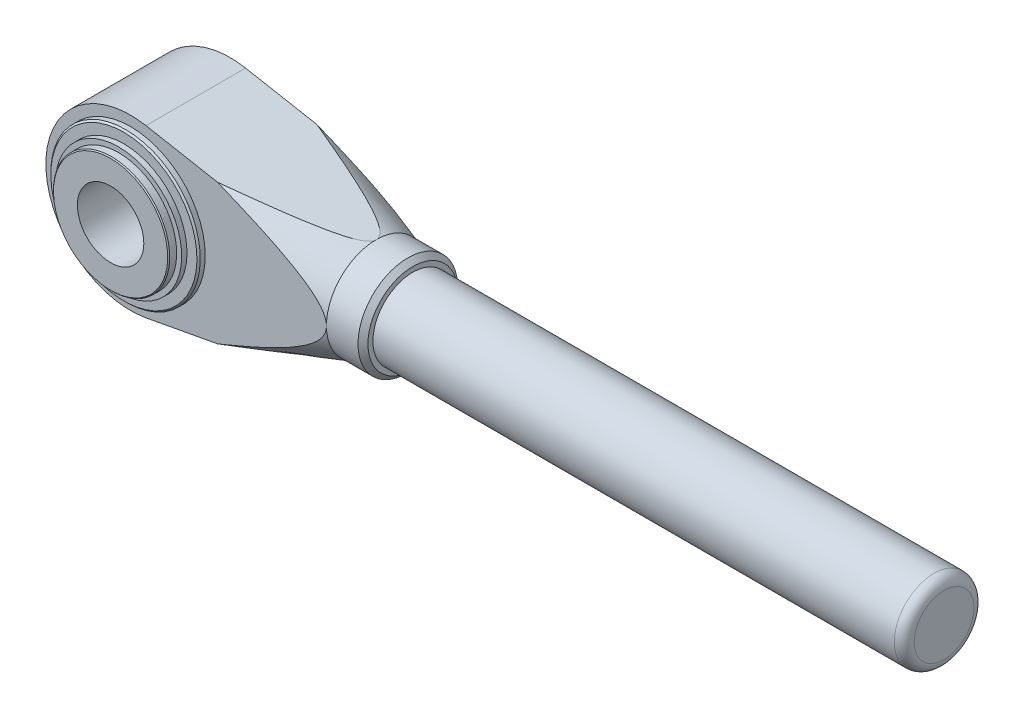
ISO-10303-21;
HEADER;
FILE_DESCRIPTION(('STEP AP214'),'2;1');
FILE_NAME('part.step','',(''),(''),'','','');
FILE_SCHEMA(('AUTOMOTIVE_DESIGN { 1 0 10303 214 1 1 1 1 }'));
ENDSEC;
DATA;
#1=APPLICATION_CONTEXT('core data for automotive mechanical design processes');
#2=APPLICATION_PROTOCOL_DEFINITION('international standard','automotive_design',2000,#1);
#3=PRODUCT_CONTEXT('',#1,'mechanical');
#4=PRODUCT('Part','Part','',(#3));
#5=PRODUCT_RELATED_PRODUCT_CATEGORY('part','',(#4));
#6=PRODUCT_DEFINITION_FORMATION('','',#4);
#7=PRODUCT_DEFINITION_CONTEXT('part definition',#1,'design');
#8=PRODUCT_DEFINITION('design','',#6,#7);
#9=PRODUCT_DEFINITION_SHAPE('','',#8);
#10=(LENGTH_UNIT() NAMED_UNIT(*) SI_UNIT(.MILLI.,.METRE.));
#11=(NAMED_UNIT(*) PLANE_ANGLE_UNIT() SI_UNIT($,.RADIAN.));
#12=(NAMED_UNIT(*) SI_UNIT($,.STERADIAN.) SOLID_ANGLE_UNIT());
#13=UNCERTAINTY_MEASURE_WITH_UNIT(LENGTH_MEASURE(1.E-05),#10,'distance_accuracy_value','');
#14=(GEOMETRIC_REPRESENTATION_CONTEXT(3) GLOBAL_UNCERTAINTY_ASSIGNED_CONTEXT((#13)) GLOBAL_UNIT_ASSIGNED_CONTEXT((#10,
#11,#12)) REPRESENTATION_CONTEXT('',''));
#15=CARTESIAN_POINT('',(0.,0.,0.));
#16=DIRECTION('',(0.,0.,1.));
#17=DIRECTION('',(1.,0.,0.));
#18=AXIS2_PLACEMENT_3D('',#15,#16,#17);
#19=CARTESIAN_POINT('',(0.,0.,6.));
#20=DIRECTION('',(0.,0.,1.));
#21=DIRECTION('',(1.,0.,0.));
#22=AXIS2_PLACEMENT_3D('',#19,#20,#21);
#23=PLANE('',#22);
#24=DIRECTION('',(-0.983257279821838,0.182222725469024,0.));
#25=VECTOR('',#24,1.);
#26=CARTESIAN_POINT('',(59.,15.,6.));
#27=LINE('',#26,#25);
#28=CARTESIAN_POINT('',(26.1613671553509,21.085838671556,6.));
#29=VERTEX_POINT('',#28);
#30=CARTESIAN_POINT('',(4.64667949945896,25.073060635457,6.));
#31=VERTEX_POINT('',#30);
#32=EDGE_CURVE('E98',#29,#31,#27,.T.);
#33=ORIENTED_EDGE('',*,*,#32,.F.);
#34=CARTESIAN_POINT('',(-7.24248853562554,-33.7584751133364,6.));
#35=CARTESIAN_POINT('',(-5.74802957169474,-33.2167856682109,6.));
#36=CARTESIAN_POINT('',(-4.25424019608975,-32.6732421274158,6.));
#37=CARTESIAN_POINT('',(-1.26826098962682,-31.5817492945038,6.));
#38=CARTESIAN_POINT('',(0.223928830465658,-31.0337999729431,6.));
#39=CARTESIAN_POINT('',(3.20676714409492,-29.9326802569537,6.));
#40=CARTESIAN_POINT('',(4.69741521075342,-29.3795087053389,6.));
#41=CARTESIAN_POINT('',(7.67646756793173,-28.2671629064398,6.));
#42=CARTESIAN_POINT('',(9.16487186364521,-27.7079886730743,6.));
#43=CARTESIAN_POINT('',(12.1444525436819,-26.5804357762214,6.));
#44=CARTESIAN_POINT('',(13.6356189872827,-26.0120308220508,6.));
#45=CARTESIAN_POINT('',(16.6146236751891,-24.8665663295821,6.));
#46=CARTESIAN_POINT('',(18.1024619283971,-24.2895068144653,6.));
#47=CARTESIAN_POINT('',(21.0738376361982,-23.1248657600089,6.));
#48=CARTESIAN_POINT('',(22.5573755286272,-22.5372853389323,6.));
#49=CARTESIAN_POINT('',(25.5191753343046,-21.3489806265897,6.));
#50=CARTESIAN_POINT('',(26.9974373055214,-20.7482564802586,6.));
#51=CARTESIAN_POINT('',(29.2088474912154,-19.8349307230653,6.));
#52=CARTESIAN_POINT('',(29.9445937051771,-19.5286166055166,6.));
#53=CARTESIAN_POINT('',(31.4140771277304,-18.9112097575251,6.));
#54=CARTESIAN_POINT('',(32.1478143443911,-18.6001170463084,6.));
#55=CARTESIAN_POINT('',(33.6130346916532,-17.972415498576,6.));
#56=CARTESIAN_POINT('',(34.3445175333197,-17.6558059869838,6.));
#57=CARTESIAN_POINT('',(35.8047075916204,-17.0162476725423,6.));
#58=CARTESIAN_POINT('',(36.5334148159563,-16.6932988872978,6.));
#59=CARTESIAN_POINT('',(37.9871396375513,-16.0401598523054,6.));
#60=CARTESIAN_POINT('',(38.712158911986,-15.7099733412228,6.));
#61=CARTESIAN_POINT('',(40.1581521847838,-15.0408629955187,6.));
#62=CARTESIAN_POINT('',(40.8791262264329,-14.7019392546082,6.));
#63=CARTESIAN_POINT('',(42.3159240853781,-14.0137035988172,6.));
#64=CARTESIAN_POINT('',(43.0317489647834,-13.6643939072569,6.));
#65=CARTESIAN_POINT('',(44.4570391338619,-12.9530760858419,6.));
#66=CARTESIAN_POINT('',(45.1665046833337,-12.5910684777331,6.));
#67=CARTESIAN_POINT('',(46.5787623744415,-11.8505232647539,6.));
#68=CARTESIAN_POINT('',(47.281536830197,-11.4719517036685,6.));
#69=CARTESIAN_POINT('',(48.3274230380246,-10.8889934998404,6.));
#70=CARTESIAN_POINT('',(48.6747283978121,-10.6921240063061,6.));
#71=CARTESIAN_POINT('',(49.3660297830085,-10.2926502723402,6.));
#72=CARTESIAN_POINT('',(49.7100258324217,-10.0900460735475,6.));
#73=CARTESIAN_POINT('',(50.3944922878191,-9.67801617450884,6.));
#74=CARTESIAN_POINT('',(50.7349578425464,-9.46858239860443,6.));
#75=CARTESIAN_POINT('',(51.4110849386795,-9.04210413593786,6.));
#76=CARTESIAN_POINT('',(51.7467466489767,-8.8250599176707,6.));
#77=CARTESIAN_POINT('',(52.4119986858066,-8.38219045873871,6.));
#78=CARTESIAN_POINT('',(52.7415920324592,-8.15636977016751,6.));
#79=CARTESIAN_POINT('',(53.393339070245,-7.69427352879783,6.));
#80=CARTESIAN_POINT('',(53.715493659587,-7.4579992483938,6.));
#81=CARTESIAN_POINT('',(54.3526544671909,-6.97115793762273,6.));
#82=CARTESIAN_POINT('',(54.6675901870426,-6.72049811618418,6.));
#83=CARTESIAN_POINT('',(55.2848809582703,-6.20374431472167,6.));
#84=CARTESIAN_POINT('',(55.5872303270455,-5.937643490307,6.));
#85=CARTESIAN_POINT('',(56.1734371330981,-5.3878612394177,6.));
#86=CARTESIAN_POINT('',(56.4573625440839,-5.10425297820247,6.));
#87=CARTESIAN_POINT('',(57.0007913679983,-4.51471907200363,6.));
#88=CARTESIAN_POINT('',(57.2603221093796,-4.20881909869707,6.));
#89=CARTESIAN_POINT('',(57.7148645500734,-3.60899692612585,6.));
#90=CARTESIAN_POINT('',(57.9138843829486,-3.31814989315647,6.));
#91=CARTESIAN_POINT('',(58.2739406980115,-2.71295260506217,6.));
#92=CARTESIAN_POINT('',(58.4349727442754,-2.3985996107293,6.));
#93=CARTESIAN_POINT('',(58.6377894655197,-1.9079841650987,6.));
#94=CARTESIAN_POINT('',(58.6992784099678,-1.73981078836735,6.));
#95=CARTESIAN_POINT('',(58.8064667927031,-1.39854555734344,6.));
#96=CARTESIAN_POINT('',(58.8521761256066,-1.22545685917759,6.));
#97=CARTESIAN_POINT('',(58.9259049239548,-0.875892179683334,6.));
#98=CARTESIAN_POINT('',(58.9539608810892,-0.699423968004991,6.));
#99=CARTESIAN_POINT('',(58.9912188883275,-0.344505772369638,6.));
#100=CARTESIAN_POINT('',(59.0004246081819,-0.16605618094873,6.));
#101=CARTESIAN_POINT('',(58.999606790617,0.165575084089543,6.));
#102=CARTESIAN_POINT('',(58.9921137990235,0.318768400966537,6.));
#103=CARTESIAN_POINT('',(58.9631852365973,0.623874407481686,6.));
#104=CARTESIAN_POINT('',(58.9417453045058,0.775786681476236,6.));
#105=CARTESIAN_POINT('',(58.8856325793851,1.07727630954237,6.));
#106=CARTESIAN_POINT('',(58.8509476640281,1.22685139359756,6.));
#107=CARTESIAN_POINT('',(58.7694386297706,1.52269249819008,6.));
#108=CARTESIAN_POINT('',(58.7226071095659,1.66895644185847,6.));
#109=CARTESIAN_POINT('',(58.5285188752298,2.20453451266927,6.));
#110=CARTESIAN_POINT('',(58.346516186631,2.58159732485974,6.));
#111=CARTESIAN_POINT('',(58.0325349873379,3.12212475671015,6.));
#112=CARTESIAN_POINT('',(57.9208566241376,3.29835585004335,6.));
#113=CARTESIAN_POINT('',(57.6861583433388,3.64316913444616,6.));
#114=CARTESIAN_POINT('',(57.563139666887,3.8117521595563,6.));
#115=CARTESIAN_POINT('',(57.2761432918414,4.18271577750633,6.));
#116=CARTESIAN_POINT('',(57.1095850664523,4.38308193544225,6.));
#117=CARTESIAN_POINT('',(56.7651310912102,4.77388601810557,6.));
#118=CARTESIAN_POINT('',(56.5872308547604,4.96431995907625,6.));
#119=CARTESIAN_POINT('',(56.2221951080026,5.33663431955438,6.));
#120=CARTESIAN_POINT('',(56.0350460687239,5.51850140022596,6.));
#121=CARTESIAN_POINT('',(55.6534937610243,5.87446950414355,6.));
#122=CARTESIAN_POINT('',(55.4590896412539,6.04856961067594,6.));
#123=CARTESIAN_POINT('',(55.0630474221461,6.3910688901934,6.));
#124=CARTESIAN_POINT('',(54.8613693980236,6.55942173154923,6.));
#125=CARTESIAN_POINT('',(54.4530662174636,6.89000939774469,6.));
#126=CARTESIAN_POINT('',(54.2464409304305,7.05224406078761,6.));
#127=CARTESIAN_POINT('',(53.829272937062,7.37113059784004,6.));
#128=CARTESIAN_POINT('',(53.6187344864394,7.52778805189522,6.));
#129=CARTESIAN_POINT('',(53.194174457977,7.83628100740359,6.));
#130=CARTESIAN_POINT('',(52.9801529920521,7.98811666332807,6.));
#131=CARTESIAN_POINT('',(52.2967929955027,8.46279000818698,6.));
#132=CARTESIAN_POINT('',(51.8219287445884,8.77768615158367,6.));
#133=CARTESIAN_POINT('',(50.8619272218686,9.39147112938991,6.));
#134=CARTESIAN_POINT('',(50.3767879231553,9.69035676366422,6.));
#135=CARTESIAN_POINT('',(49.398389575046,10.2752748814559,6.));
#136=CARTESIAN_POINT('',(48.905125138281,10.5612983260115,6.));
#137=CARTESIAN_POINT('',(47.9125453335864,11.1225212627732,6.));
#138=CARTESIAN_POINT('',(47.413230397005,11.397721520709,6.));
#139=CARTESIAN_POINT('',(46.4084053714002,11.9397744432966,6.));
#140=CARTESIAN_POINT('',(45.9028824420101,12.2066032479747,6.));
#141=CARTESIAN_POINT('',(44.8878303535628,12.7325312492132,6.));
#142=CARTESIAN_POINT('',(44.3783011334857,12.9916303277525,6.));
#143=CARTESIAN_POINT('',(43.3561225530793,13.5030916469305,6.));
#144=CARTESIAN_POINT('',(42.8434744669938,13.755456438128,6.));
#145=CARTESIAN_POINT('',(41.8153823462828,14.2544310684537,6.));
#146=CARTESIAN_POINT('',(41.2999382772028,14.501040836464,6.));
#147=CARTESIAN_POINT('',(39.7469162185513,15.2348380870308,6.));
#148=CARTESIAN_POINT('',(38.7057566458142,15.71445032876,6.));
#149=CARTESIAN_POINT('',(36.616285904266,16.6579964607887,6.));
#150=CARTESIAN_POINT('',(35.5679741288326,17.121929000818,6.));
#151=CARTESIAN_POINT('',(33.4676095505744,18.0364480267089,6.));
#152=CARTESIAN_POINT('',(32.4155657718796,18.487055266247,6.));
#153=CARTESIAN_POINT('',(30.8342792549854,19.155268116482,6.));
#154=CARTESIAN_POINT('',(30.3066555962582,19.376719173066,6.));
#155=CARTESIAN_POINT('',(29.2504329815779,19.8172830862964,6.));
#156=CARTESIAN_POINT('',(28.7218340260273,20.0363959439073,6.));
#157=CARTESIAN_POINT('',(27.0165646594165,20.7392487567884,6.));
#158=CARTESIAN_POINT('',(25.8381668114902,21.2188003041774,6.));
#159=CARTESIAN_POINT('',(23.4778839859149,22.1692524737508,6.));
#160=CARTESIAN_POINT('',(22.2959989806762,22.6401530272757,6.));
#161=CARTESIAN_POINT('',(19.9293348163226,23.5747218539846,6.));
#162=CARTESIAN_POINT('',(18.744555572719,24.0383899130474,6.));
#163=CARTESIAN_POINT('',(16.3726185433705,24.9595882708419,6.));
#164=CARTESIAN_POINT('',(15.1854607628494,25.4171185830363,6.));
#165=CARTESIAN_POINT('',(12.8090055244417,26.3269793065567,6.));
#166=CARTESIAN_POINT('',(11.6197078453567,26.7793091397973,6.));
#167=CARTESIAN_POINT('',(9.23939556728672,27.6794302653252,6.));
#168=CARTESIAN_POINT('',(8.04838096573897,28.1272215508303,6.));
#169=CARTESIAN_POINT('',(4.47312260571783,29.4647021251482,6.));
#170=CARTESIAN_POINT('',(2.08667191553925,30.3484952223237,6.));
#171=CARTESIAN_POINT('',(-1.49773456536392,31.6655880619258,6.));
#172=CARTESIAN_POINT('',(-2.69402340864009,32.103438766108,6.));
#173=CARTESIAN_POINT('',(-5.08758899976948,32.9764205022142,6.));
#174=CARTESIAN_POINT('',(-6.28486574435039,33.4115515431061,6.));
#175=CARTESIAN_POINT('',(-9.87801679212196,34.7133311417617,6.));
#176=CARTESIAN_POINT('',(-12.2752017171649,35.5763624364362,6.));
#177=CARTESIAN_POINT('',(-17.0721886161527,37.2946024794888,6.));
#178=CARTESIAN_POINT('',(-19.471990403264,38.1498117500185,6.));
#179=CARTESIAN_POINT('',(-24.2738490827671,39.8538646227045,6.));
#180=CARTESIAN_POINT('',(-26.6759059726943,40.7027082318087,6.));
#181=CARTESIAN_POINT('',(-31.3729301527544,42.3567456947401,6.));
#182=CARTESIAN_POINT('',(-33.6678150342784,43.1621736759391,6.));
#183=CARTESIAN_POINT('',(-38.2590140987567,44.7689462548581,6.));
#184=CARTESIAN_POINT('',(-40.5553282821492,45.5702908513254,6.));
#185=CARTESIAN_POINT('',(-47.4461774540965,47.9691544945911,6.));
#186=CARTESIAN_POINT('',(-52.0425242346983,49.5614700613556,6.));
#187=CARTESIAN_POINT('',(-58.935980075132,51.940876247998,6.));
#188=CARTESIAN_POINT('',(-61.2317479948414,52.7318585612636,6.));
#189=CARTESIAN_POINT('',(-65.824067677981,54.3115457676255,6.));
#190=CARTESIAN_POINT('',(-68.1206194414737,55.10025066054,6.));
#191=CARTESIAN_POINT('',(-72.7143490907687,56.6756440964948,6.));
#192=CARTESIAN_POINT('',(-75.0115269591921,57.4623326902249,6.));
#193=CARTESIAN_POINT('',(-79.6064886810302,59.0339360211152,6.));
#194=CARTESIAN_POINT('',(-81.9042725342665,59.8188507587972,6.));
#195=CARTESIAN_POINT('',(-84.202320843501,60.602989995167,6.));
#196=B_SPLINE_CURVE_WITH_KNOTS('',3,(#34,#35,#36,#37,#38,#39,#40,#41,#42,#43,#44,#45,#46,#47,
#48,#49,#50,#51,#52,#53,#54,#55,#56,#57,#58,#59,#60,#61,#62,#63,#64,#65,#66,#67,#68,#69,#70,#71,
#72,#73,#74,#75,#76,#77,#78,#79,#80,#81,#82,#83,#84,#85,#86,#87,#88,#89,#90,#91,#92,#93,#94,#95,
#96,#97,#98,#99,#100,#101,#102,#103,#104,#105,#106,#107,#108,#109,#110,#111,#112,#113,#114,#115,
#116,#117,#118,#119,#120,#121,#122,#123,#124,#125,#126,#127,#128,#129,#130,#131,#132,#133,#134,
#135,#136,#137,#138,#139,#140,#141,#142,#143,#144,#145,#146,#147,#148,#149,#150,#151,#152,#153,
#154,#155,#156,#157,#158,#159,#160,#161,#162,#163,#164,#165,#166,#167,#168,#169,#170,#171,#172,
#173,#174,#175,#176,#177,#178,#179,#180,#181,#182,#183,#184,#185,#186,#187,#188,#189,#190,#191,
#192,#193,#194,#195),.UNSPECIFIED.,.F.,.F.,(4,2,2,2,2,2,2,2,2,2,2,2,2,2,2,2,2,2,2,2,2,2,2,2,2,2,
2,2,2,2,2,2,2,2,2,2,2,2,2,2,2,2,2,2,2,2,2,2,2,2,2,2,2,2,2,2,2,2,2,2,2,2,2,2,2,2,2,2,2,2,2,2,2,2,
2,2,2,2,2,2,4),(0.,4.7688087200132,9.53764933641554,14.3075727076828,19.0774850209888,
23.8649421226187,28.6523864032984,33.4393248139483,38.2262104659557,40.6170875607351,
43.0079550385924,45.3991171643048,47.7902726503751,50.1802208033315,52.5701433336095,
54.9595578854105,57.348874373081,59.7433422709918,60.940966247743,62.1385815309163,
63.3376683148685,64.5367128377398,65.7351435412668,66.9334287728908,68.1405772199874,
69.3482648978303,70.5512085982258,71.7527882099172,72.8080930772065,73.8635211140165,
74.4000728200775,74.9362874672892,75.4713900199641,76.0063883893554,76.4658799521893,
76.9255152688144,77.385572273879,77.845910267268,79.0937424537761,79.7194436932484,
80.345076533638,81.1262135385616,81.9076614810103,82.6902884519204,83.4730075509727,
84.2610020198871,85.0490173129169,85.8362206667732,86.6233987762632,88.3322841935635,
90.0415099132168,91.7519186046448,93.4622060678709,95.1769919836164,96.8918040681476,
98.6059571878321,100.320131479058,103.758888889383,107.197941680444,110.631321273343,
112.347954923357,114.064587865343,117.881256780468,121.697955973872,125.514767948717,
129.33157155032,133.148795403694,136.966024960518,144.600508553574,148.422205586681,
152.243890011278,159.887291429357,167.530178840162,175.17305790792,182.469415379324,
189.76577508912,204.358796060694,211.643425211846,218.92805494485,226.212499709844,
233.496942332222),.UNSPECIFIED.);
#197=CARTESIAN_POINT('',(59.,0.,6.));
#198=VERTEX_POINT('',#197);
#199=EDGE_CURVE('E75',#29,#198,#196,.F.);
#200=ORIENTED_EDGE('',*,*,#199,.T.);
#201=CARTESIAN_POINT('',(26.1613671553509,-21.0858386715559,6.));
#202=VERTEX_POINT('',#201);
#203=EDGE_CURVE('E87',#198,#202,#196,.F.);
#204=ORIENTED_EDGE('',*,*,#203,.T.);
#205=DIRECTION('',(-0.983257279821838,-0.182222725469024,0.));
#206=VECTOR('',#205,1.);
#207=CARTESIAN_POINT('',(59.,-15.0000000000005,6.));
#208=LINE('',#207,#206);
#209=CARTESIAN_POINT('',(4.64667949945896,-25.0730606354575,6.));
#210=VERTEX_POINT('',#209);
#211=EDGE_CURVE('E173',#202,#210,#208,.T.);
#212=ORIENTED_EDGE('',*,*,#211,.T.);
#213=CARTESIAN_POINT('',(0.,0.,6.));
#214=DIRECTION('',(0.,0.,1.));
#215=DIRECTION('',(1.,0.,0.));
#216=AXIS2_PLACEMENT_3D('',#213,#214,#215);
#217=CIRCLE('',#216,25.5);
#218=EDGE_CURVE('E176',#31,#210,#217,.T.);
#219=ORIENTED_EDGE('',*,*,#218,.F.);
#220=EDGE_LOOP('',(#33,#200,#204,#212,#219));
#221=FACE_BOUND('',#220,.T.);
#222=CARTESIAN_POINT('',(0.,0.,6.));
#223=DIRECTION('',(0.,0.,1.));
#224=DIRECTION('',(1.,0.,0.));
#225=AXIS2_PLACEMENT_3D('',#222,#223,#224);
#226=CIRCLE('',#225,22.5);
#227=CARTESIAN_POINT('',(22.5,0.,6.));
#228=VERTEX_POINT('',#227);
#229=EDGE_CURVE('E132',#228,#228,#226,.F.);
#230=ORIENTED_EDGE('',*,*,#229,.F.);
#231=EDGE_LOOP('',(#230));
#232=FACE_BOUND('',#231,.T.);
#233=ADVANCED_FACE('F15',(#221,#232),#23,.F.);
#234=CARTESIAN_POINT('',(59.,15.,36.));
#235=DIRECTION('',(-0.182222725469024,-0.983257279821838,0.));
#236=DIRECTION('',(0.983257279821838,-0.182222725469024,0.));
#237=AXIS2_PLACEMENT_3D('',#234,#235,#236);
#238=PLANE('',#237);
#239=DIRECTION('',(-0.983257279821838,0.182222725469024,0.));
#240=VECTOR('',#239,1.);
#241=CARTESIAN_POINT('',(59.,15.,36.));
#242=LINE('',#241,#240);
#243=CARTESIAN_POINT('',(26.1613671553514,21.085838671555,36.));
#244=VERTEX_POINT('',#243);
#245=CARTESIAN_POINT('',(4.64667949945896,25.073060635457,36.));
#246=VERTEX_POINT('',#245);
#247=EDGE_CURVE('E168',#244,#246,#242,.T.);
#248=ORIENTED_EDGE('',*,*,#247,.F.);
#249=CARTESIAN_POINT('',(26.1607238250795,21.085957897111,36.0002));
#250=CARTESIAN_POINT('',(26.9337304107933,20.9427000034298,35.759869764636));
#251=CARTESIAN_POINT('',(27.7063976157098,20.7995050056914,35.5184048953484));
#252=CARTESIAN_POINT('',(29.2509196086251,20.5132655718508,35.0327775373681));
#253=CARTESIAN_POINT('',(30.0227743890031,20.370221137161,34.7886150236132));
#254=CARTESIAN_POINT('',(31.5658049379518,20.0842581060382,34.2970788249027));
#255=CARTESIAN_POINT('',(32.3369803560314,19.9413395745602,34.0497040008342));
#256=CARTESIAN_POINT('',(33.8781781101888,19.6557162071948,33.551272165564));
#257=CARTESIAN_POINT('',(34.6482004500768,19.5130113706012,33.3002151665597));
#258=CARTESIAN_POINT('',(36.1835885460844,19.2284646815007,32.7947896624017));
#259=CARTESIAN_POINT('',(36.9489602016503,19.0866217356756,32.5404397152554));
#260=CARTESIAN_POINT('',(38.4779983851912,18.8032518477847,32.0264943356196));
#261=CARTESIAN_POINT('',(39.2416649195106,18.6617249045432,31.7668989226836));
#262=CARTESIAN_POINT('',(40.7667107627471,18.3790948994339,31.2413263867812));
#263=CARTESIAN_POINT('',(41.5280904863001,18.2379917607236,30.9753505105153));
#264=CARTESIAN_POINT('',(43.0480863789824,17.9562976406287,30.4353666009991));
#265=CARTESIAN_POINT('',(43.8067025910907,17.815706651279,30.16135869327));
#266=CARTESIAN_POINT('',(45.3207607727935,17.5351129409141,29.6028638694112));
#267=CARTESIAN_POINT('',(46.0762003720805,17.3951106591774,29.3183702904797));
#268=CARTESIAN_POINT('',(47.5822489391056,17.1160013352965,28.7357122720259));
#269=CARTESIAN_POINT('',(48.3328565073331,16.9768945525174,28.4375440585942));
#270=CARTESIAN_POINT('',(49.4551456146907,16.7689056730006,27.975367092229));
#271=CARTESIAN_POINT('',(49.8296241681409,16.6995052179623,27.8183853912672));
#272=CARTESIAN_POINT('',(50.5762011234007,16.5611454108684,27.4986824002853));
#273=CARTESIAN_POINT('',(50.948299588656,16.4921860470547,27.33596126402));
#274=CARTESIAN_POINT('',(51.6892559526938,16.3548678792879,27.003621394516));
#275=CARTESIAN_POINT('',(52.0581156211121,16.2865087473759,26.8340067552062));
#276=CARTESIAN_POINT('',(52.7918380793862,16.1505312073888,26.4860871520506));
#277=CARTESIAN_POINT('',(53.1567011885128,16.0829127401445,26.307782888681));
#278=CARTESIAN_POINT('',(53.8836975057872,15.948181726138,25.9386753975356));
#279=CARTESIAN_POINT('',(54.2457899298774,15.8810767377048,25.7477887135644));
#280=CARTESIAN_POINT('',(54.9625406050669,15.7482445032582,25.3508562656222));
#281=CARTESIAN_POINT('',(55.3171895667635,15.6825189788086,25.1447928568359));
#282=CARTESIAN_POINT('',(55.8386513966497,15.5858787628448,24.8208949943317));
#283=CARTESIAN_POINT('',(56.0101471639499,15.5540962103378,24.7108660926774));
#284=CARTESIAN_POINT('',(56.3491463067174,15.491270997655,24.4846422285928));
#285=CARTESIAN_POINT('',(56.5166503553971,15.4602282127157,24.3684483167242));
#286=CARTESIAN_POINT('',(56.8460945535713,15.3991737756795,24.128789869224));
#287=CARTESIAN_POINT('',(57.0080447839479,15.3691602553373,24.0053397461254));
#288=CARTESIAN_POINT('',(57.324732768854,15.3104698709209,23.7492726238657));
#289=CARTESIAN_POINT('',(57.4794747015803,15.2817922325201,23.6166610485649));
#290=CARTESIAN_POINT('',(57.7079534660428,15.2394492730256,23.4053643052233));
#291=CARTESIAN_POINT('',(57.7853937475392,15.2250976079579,23.3308319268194));
#292=CARTESIAN_POINT('',(57.9367471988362,15.1970479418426,23.1781480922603));
#293=CARTESIAN_POINT('',(58.0106597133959,15.1833500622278,23.0999959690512));
#294=CARTESIAN_POINT('',(58.2258983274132,15.1434608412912,22.8594592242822));
#295=CARTESIAN_POINT('',(58.3608526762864,15.1184503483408,22.6908802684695));
#296=CARTESIAN_POINT('',(58.5713345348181,15.0794426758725,22.3808432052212));
#297=CARTESIAN_POINT('',(58.6531645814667,15.0642774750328,22.2438702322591));
#298=CARTESIAN_POINT('',(58.7952444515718,15.0379464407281,21.9587270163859));
#299=CARTESIAN_POINT('',(58.8555406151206,15.0267720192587,21.8105816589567));
#300=CARTESIAN_POINT('',(58.937256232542,15.011628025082,21.5377929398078));
#301=CARTESIAN_POINT('',(58.9642323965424,15.0066286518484,21.41489978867));
#302=CARTESIAN_POINT('',(58.9971981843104,15.0005192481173,21.1662545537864));
#303=CARTESIAN_POINT('',(59.0032091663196,14.9994052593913,21.0405055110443));
#304=CARTESIAN_POINT('',(58.9935045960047,15.0012037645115,20.7898837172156));
#305=CARTESIAN_POINT('',(58.977785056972,15.0041169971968,20.6650111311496));
#306=CARTESIAN_POINT('',(58.9265565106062,15.0136109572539,20.4195313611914));
#307=CARTESIAN_POINT('',(58.8910232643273,15.0201961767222,20.2989295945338));
#308=CARTESIAN_POINT('',(58.784018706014,15.0400268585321,20.0112943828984));
#309=CARTESIAN_POINT('',(58.7035724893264,15.0549356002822,19.8477613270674));
#310=CARTESIAN_POINT('',(58.5191967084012,15.0891051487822,19.5351348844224));
#311=CARTESIAN_POINT('',(58.4152057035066,15.1083773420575,19.3860807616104));
#312=CARTESIAN_POINT('',(58.1666929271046,15.1544331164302,19.0690255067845));
#313=CARTESIAN_POINT('',(58.0183045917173,15.1819332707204,18.9042149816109));
#314=CARTESIAN_POINT('',(57.706654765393,15.2396899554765,18.5896489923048));
#315=CARTESIAN_POINT('',(57.5433654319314,15.2699516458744,18.4399228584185));
#316=CARTESIAN_POINT('',(57.2059370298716,15.3324857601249,18.1515429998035));
#317=CARTESIAN_POINT('',(57.0317358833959,15.3647696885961,18.0129652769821));
#318=CARTESIAN_POINT('',(56.6765912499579,15.4305870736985,17.7455276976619));
#319=CARTESIAN_POINT('',(56.4956542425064,15.4641193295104,17.6166588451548));
#320=CARTESIAN_POINT('',(56.1249127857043,15.5328272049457,17.3639945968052));
#321=CARTESIAN_POINT('',(55.9350020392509,15.5680225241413,17.2403615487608));
#322=CARTESIAN_POINT('',(55.5512085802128,15.6391492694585,16.9996223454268));
#323=CARTESIAN_POINT('',(55.3573252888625,15.6750808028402,16.8825171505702));
#324=CARTESIAN_POINT('',(54.7708924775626,15.7837618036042,16.5391298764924));
#325=CARTESIAN_POINT('',(54.3737781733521,15.8573572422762,16.3209203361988));
#326=CARTESIAN_POINT('',(53.5708189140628,16.0061661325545,15.899369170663));
#327=CARTESIAN_POINT('',(53.1649540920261,16.0813832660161,15.6960673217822));
#328=CARTESIAN_POINT('',(52.3479367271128,16.2327974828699,15.3011840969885));
#329=CARTESIAN_POINT('',(51.9367859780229,16.3089942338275,15.1095988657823));
#330=CARTESIAN_POINT('',(51.1092277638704,16.4623619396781,14.73488650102));
#331=CARTESIAN_POINT('',(50.692807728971,16.5395352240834,14.5517882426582));
#332=CARTESIAN_POINT('',(49.8569242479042,16.6944458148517,14.19285415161));
#333=CARTESIAN_POINT('',(49.4374605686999,16.7721831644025,14.0170188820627));
#334=CARTESIAN_POINT('',(48.5968359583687,16.9279724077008,13.671552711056));
#335=CARTESIAN_POINT('',(48.175678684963,17.006023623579,13.5019125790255));
#336=CARTESIAN_POINT('',(47.3314772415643,17.1624757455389,13.1675526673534));
#337=CARTESIAN_POINT('',(46.9084330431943,17.2408766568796,13.0028329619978));
#338=CARTESIAN_POINT('',(45.6405211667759,17.4758531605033,12.5162038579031));
#339=CARTESIAN_POINT('',(44.7933852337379,17.6328491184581,12.2004074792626));
#340=CARTESIAN_POINT('',(43.0948714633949,17.9476271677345,11.5808148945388));
#341=CARTESIAN_POINT('',(42.2434934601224,18.1054092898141,11.2770191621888));
#342=CARTESIAN_POINT('',(40.5369743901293,18.4216709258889,10.6784153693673));
#343=CARTESIAN_POINT('',(39.6818309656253,18.5801508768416,10.3836142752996));
#344=CARTESIAN_POINT('',(37.9691591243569,18.8975527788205,9.80126681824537));
#345=CARTESIAN_POINT('',(37.1116306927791,19.0564747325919,9.51372050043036));
#346=CARTESIAN_POINT('',(35.4144475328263,19.3710061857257,8.95101298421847));
#347=CARTESIAN_POINT('',(34.5748352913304,19.5266078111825,8.67571903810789));
#348=CARTESIAN_POINT('',(32.8941660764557,19.83807880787,8.12971741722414));
#349=CARTESIAN_POINT('',(32.0531090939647,19.9939481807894,7.85900977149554));
#350=CARTESIAN_POINT('',(30.3707180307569,20.3057382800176,7.32170540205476));
#351=CARTESIAN_POINT('',(29.5293852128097,20.4616587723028,7.05510458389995));
#352=CARTESIAN_POINT('',(27.8457431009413,20.7736807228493,6.52515547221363));
#353=CARTESIAN_POINT('',(27.0034338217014,20.9297821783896,6.26180713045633));
#354=CARTESIAN_POINT('',(26.1607238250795,21.085957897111,5.99979999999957));
#355=B_SPLINE_CURVE_WITH_KNOTS('',3,(#249,#250,#251,#252,#253,#254,#255,#256,#257,#258,#259,
#260,#261,#262,#263,#264,#265,#266,#267,#268,#269,#270,#271,#272,#273,#274,#275,#276,#277,#278,
#279,#280,#281,#282,#283,#284,#285,#286,#287,#288,#289,#290,#291,#292,#293,#294,#295,#296,#297,
#298,#299,#300,#301,#302,#303,#304,#305,#306,#307,#308,#309,#310,#311,#312,#313,#314,#315,#316,
#317,#318,#319,#320,#321,#322,#323,#324,#325,#326,#327,#328,#329,#330,#331,#332,#333,#334,#335,
#336,#337,#338,#339,#340,#341,#342,#343,#344,#345,#346,#347,#348,#349,#350,#351,#352,#353,#354),
.UNSPECIFIED.,.F.,.F.,(4,2,2,2,2,2,2,2,2,2,2,2,2,2,2,2,2,2,2,2,2,2,2,2,2,2,2,2,2,2,2,2,2,2,2,2,
2,2,2,2,2,2,2,2,2,2,2,2,2,2,2,2,4),(0.,2.46625086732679,4.93252466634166,7.39969830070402,
9.8668637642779,12.3235667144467,14.7802605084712,17.2364781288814,19.6926573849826,
22.1504252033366,24.6088754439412,25.8446569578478,27.0804053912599,28.3154303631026,
29.5503559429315,30.7945112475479,32.0401365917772,32.6587020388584,33.2771624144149,
33.8944333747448,34.5113419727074,34.8365310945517,35.1617803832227,35.811763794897,
36.2912514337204,36.7697009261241,37.1458201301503,37.5215560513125,37.8973609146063,
38.2736265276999,38.8190466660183,39.3659068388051,40.0347568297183,40.7048832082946,
41.3792470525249,42.0529781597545,42.7407916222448,43.4287060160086,44.8053274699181,
46.1854975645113,47.5652110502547,48.9493178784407,50.3335318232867,51.7155913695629,
53.0976717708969,55.8503721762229,58.6031811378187,61.3580706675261,64.1129773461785,
66.8045276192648,69.4960949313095,72.1847779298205,74.8734210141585),.UNSPECIFIED.);
#356=CARTESIAN_POINT('',(59.,15.,21.));
#357=VERTEX_POINT('',#356);
#358=EDGE_CURVE('E155',#244,#357,#355,.T.);
#359=ORIENTED_EDGE('',*,*,#358,.T.);
#360=EDGE_CURVE('E77',#357,#29,#355,.T.);
#361=ORIENTED_EDGE('',*,*,#360,.T.);
#362=ORIENTED_EDGE('',*,*,#32,.T.);
#363=DIRECTION('',(0.,0.,-1.));
#364=VECTOR('',#363,1.);
#365=CARTESIAN_POINT('',(4.64667949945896,25.073060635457,36.));
#366=LINE('',#365,#364);
#367=EDGE_CURVE('E107',#246,#31,#366,.T.);
#368=ORIENTED_EDGE('',*,*,#367,.F.);
#369=EDGE_LOOP('',(#248,#359,#361,#362,#368));
#370=FACE_BOUND('',#369,.T.);
#371=ADVANCED_FACE('F253',(#370),#238,.F.);
#372=CARTESIAN_POINT('',(0.,0.,36.));
#373=DIRECTION('',(0.,0.,-1.));
#374=DIRECTION('',(-1.,0.,0.));
#375=AXIS2_PLACEMENT_3D('',#372,#373,#374);
#376=CYLINDRICAL_SURFACE('',#375,25.5);
#377=DIRECTION('',(0.,0.,-1.));
#378=VECTOR('',#377,1.);
#379=CARTESIAN_POINT('',(4.64667949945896,-25.0730606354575,36.));
#380=LINE('',#379,#378);
#381=CARTESIAN_POINT('',(4.64667949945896,-25.0730606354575,36.));
#382=VERTEX_POINT('',#381);
#383=EDGE_CURVE('E164',#382,#210,#380,.T.);
#384=ORIENTED_EDGE('',*,*,#383,.F.);
#385=CARTESIAN_POINT('',(0.,0.,36.));
#386=DIRECTION('',(0.,0.,1.));
#387=DIRECTION('',(1.,0.,0.));
#388=AXIS2_PLACEMENT_3D('',#385,#386,#387);
#389=CIRCLE('',#388,25.5);
#390=EDGE_CURVE('E162',#246,#382,#389,.T.);
#391=ORIENTED_EDGE('',*,*,#390,.F.);
#392=ORIENTED_EDGE('',*,*,#367,.T.);
#393=ORIENTED_EDGE('',*,*,#218,.T.);
#394=EDGE_LOOP('',(#384,#391,#392,#393));
#395=FACE_BOUND('',#394,.T.);
#396=ADVANCED_FACE('F260',(#395),#376,.T.);
#397=CARTESIAN_POINT('',(59.,-15.0000000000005,36.));
#398=DIRECTION('',(0.182222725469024,-0.983257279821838,0.));
#399=DIRECTION('',(0.983257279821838,0.182222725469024,0.));
#400=AXIS2_PLACEMENT_3D('',#397,#398,#399);
#401=PLANE('',#400);
#402=CARTESIAN_POINT('',(26.1607238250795,-21.085957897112,36.0002));
#403=CARTESIAN_POINT('',(26.9337304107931,-20.9427000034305,35.7598697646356));
#404=CARTESIAN_POINT('',(27.7063976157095,-20.799505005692,35.5184048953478));
#405=CARTESIAN_POINT('',(29.2509196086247,-20.5132655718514,35.0327775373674));
#406=CARTESIAN_POINT('',(30.0227743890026,-20.3702211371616,34.7886150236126));
#407=CARTESIAN_POINT('',(31.5658049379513,-20.0842581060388,34.2970788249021));
#408=CARTESIAN_POINT('',(32.3369803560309,-19.9413395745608,34.0497040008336));
#409=CARTESIAN_POINT('',(33.8781781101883,-19.6557162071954,33.5512721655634));
#410=CARTESIAN_POINT('',(34.6482004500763,-19.5130113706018,33.3002151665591));
#411=CARTESIAN_POINT('',(36.183588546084,-19.2284646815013,32.794789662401));
#412=CARTESIAN_POINT('',(36.9489602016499,-19.0866217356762,32.5404397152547));
#413=CARTESIAN_POINT('',(38.4779983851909,-18.8032518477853,32.0264943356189));
#414=CARTESIAN_POINT('',(39.2416649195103,-18.6617249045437,31.7668989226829));
#415=CARTESIAN_POINT('',(40.7667107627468,-18.3790948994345,31.2413263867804));
#416=CARTESIAN_POINT('',(41.5280904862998,-18.2379917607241,30.9753505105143));
#417=CARTESIAN_POINT('',(43.0480863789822,-17.9562976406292,30.4353666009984));
#418=CARTESIAN_POINT('',(43.8067025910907,-17.8157066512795,30.16135869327));
#419=CARTESIAN_POINT('',(45.3207607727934,-17.5351129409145,29.6028638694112));
#420=CARTESIAN_POINT('',(46.0762003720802,-17.3951106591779,29.318370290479));
#421=CARTESIAN_POINT('',(47.5822489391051,-17.1160013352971,28.7357122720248));
#422=CARTESIAN_POINT('',(48.3328565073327,-16.976894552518,28.4375440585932));
#423=CARTESIAN_POINT('',(49.4551456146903,-16.7689056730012,27.9753670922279));
#424=CARTESIAN_POINT('',(49.8296241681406,-16.6995052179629,27.8183853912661));
#425=CARTESIAN_POINT('',(50.5762011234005,-16.5611454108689,27.4986824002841));
#426=CARTESIAN_POINT('',(50.9482995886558,-16.4921860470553,27.3359612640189));
#427=CARTESIAN_POINT('',(51.6892559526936,-16.3548678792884,27.0036213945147));
#428=CARTESIAN_POINT('',(52.0581156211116,-16.2865087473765,26.8340067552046));
#429=CARTESIAN_POINT('',(52.7918380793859,-16.1505312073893,26.4860871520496));
#430=CARTESIAN_POINT('',(53.1567011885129,-16.082912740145,26.307782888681));
#431=CARTESIAN_POINT('',(53.883697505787,-15.9481817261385,25.9386753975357));
#432=CARTESIAN_POINT('',(54.2457899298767,-15.8810767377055,25.7477887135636));
#433=CARTESIAN_POINT('',(54.9625406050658,-15.7482445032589,25.3508562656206));
#434=CARTESIAN_POINT('',(55.3171895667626,-15.6825189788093,25.1447928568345));
#435=CARTESIAN_POINT('',(55.8386513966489,-15.5858787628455,24.8208949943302));
#436=CARTESIAN_POINT('',(56.0101471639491,-15.5540962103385,24.7108660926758));
#437=CARTESIAN_POINT('',(56.3491463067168,-15.4912709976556,24.4846422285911));
#438=CARTESIAN_POINT('',(56.5166503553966,-15.4602282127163,24.3684483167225));
#439=CARTESIAN_POINT('',(56.8460945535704,-15.3991737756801,24.1287898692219));
#440=CARTESIAN_POINT('',(57.0080447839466,-15.369160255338,24.0053397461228));
#441=CARTESIAN_POINT('',(57.3247327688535,-15.3104698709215,23.7492726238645));
#442=CARTESIAN_POINT('',(57.4794747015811,-15.2817922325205,23.6166610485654));
#443=CARTESIAN_POINT('',(57.7079534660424,-15.2394492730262,23.405364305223));
#444=CARTESIAN_POINT('',(57.7853937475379,-15.2250976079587,23.3308319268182));
#445=CARTESIAN_POINT('',(57.936747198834,-15.1970479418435,23.1781480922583));
#446=CARTESIAN_POINT('',(58.0106597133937,-15.1833500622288,23.0999959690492));
#447=CARTESIAN_POINT('',(58.2258983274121,-15.1434608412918,22.8594592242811));
#448=CARTESIAN_POINT('',(58.3608526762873,-15.1184503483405,22.6908802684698));
#449=CARTESIAN_POINT('',(58.5713345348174,-15.0794426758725,22.3808432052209));
#450=CARTESIAN_POINT('',(58.6531645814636,-15.0642774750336,22.2438702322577));
#451=CARTESIAN_POINT('',(58.7952444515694,-15.0379464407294,21.9587270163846));
#452=CARTESIAN_POINT('',(58.8555406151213,-15.0267720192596,21.8105816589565));
#453=CARTESIAN_POINT('',(58.9372562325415,-15.0116280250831,21.537792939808));
#454=CARTESIAN_POINT('',(58.9642323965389,-15.0066286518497,21.4148997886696));
#455=CARTESIAN_POINT('',(58.9971981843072,-15.0005192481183,21.1662545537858));
#456=CARTESIAN_POINT('',(59.0032091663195,-14.9994052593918,21.0405055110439));
#457=CARTESIAN_POINT('',(58.9935045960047,-15.0012037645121,20.789883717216));
#458=CARTESIAN_POINT('',(58.9777850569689,-15.0041169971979,20.6650111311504));
#459=CARTESIAN_POINT('',(58.9265565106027,-15.013610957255,20.419531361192));
#460=CARTESIAN_POINT('',(58.8910232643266,-15.0201961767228,20.2989295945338));
#461=CARTESIAN_POINT('',(58.784018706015,-15.0400268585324,20.0112943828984));
#462=CARTESIAN_POINT('',(58.7035724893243,-15.0549356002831,19.8477613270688));
#463=CARTESIAN_POINT('',(58.5191967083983,-15.0891051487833,19.535134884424));
#464=CARTESIAN_POINT('',(58.415205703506,-15.1083773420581,19.3860807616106));
#465=CARTESIAN_POINT('',(58.1666929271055,-15.1544331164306,19.0690255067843));
#466=CARTESIAN_POINT('',(58.0183045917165,-15.1819332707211,18.9042149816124));
#467=CARTESIAN_POINT('',(57.706654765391,-15.2396899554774,18.5896489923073));
#468=CARTESIAN_POINT('',(57.54336543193,-15.2699516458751,18.4399228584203));
#469=CARTESIAN_POINT('',(57.2059370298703,-15.3324857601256,18.151542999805));
#470=CARTESIAN_POINT('',(57.0317358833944,-15.364769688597,18.012965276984));
#471=CARTESIAN_POINT('',(56.6765912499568,-15.4305870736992,17.745527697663));
#472=CARTESIAN_POINT('',(56.4956542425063,-15.4641193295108,17.6166588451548));
#473=CARTESIAN_POINT('',(56.1249127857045,-15.5328272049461,17.3639945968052));
#474=CARTESIAN_POINT('',(55.9350020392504,-15.5680225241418,17.240361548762));
#475=CARTESIAN_POINT('',(55.5512085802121,-15.6391492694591,16.9996223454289));
#476=CARTESIAN_POINT('',(55.357325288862,-15.6750808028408,16.882517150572));
#477=CARTESIAN_POINT('',(54.7708924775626,-15.7837618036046,16.5391298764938));
#478=CARTESIAN_POINT('',(54.3737781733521,-15.8573572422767,16.3209203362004));
#479=CARTESIAN_POINT('',(53.5708189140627,-16.006166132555,15.8993691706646));
#480=CARTESIAN_POINT('',(53.1649540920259,-16.0813832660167,15.6960673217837));
#481=CARTESIAN_POINT('',(52.3479367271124,-16.2327974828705,15.3011840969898));
#482=CARTESIAN_POINT('',(51.9367859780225,-16.3089942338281,15.1095988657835));
#483=CARTESIAN_POINT('',(51.1092277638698,-16.4623619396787,14.7348865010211));
#484=CARTESIAN_POINT('',(50.6928077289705,-16.539535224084,14.5517882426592));
#485=CARTESIAN_POINT('',(49.8569242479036,-16.6944458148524,14.1928541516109));
#486=CARTESIAN_POINT('',(49.4374605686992,-16.7721831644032,14.0170188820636));
#487=CARTESIAN_POINT('',(48.596835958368,-16.9279724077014,13.671552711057));
#488=CARTESIAN_POINT('',(48.1756786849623,-17.0060236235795,13.5019125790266));
#489=CARTESIAN_POINT('',(47.3314772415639,-17.1624757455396,13.1675526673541));
#490=CARTESIAN_POINT('',(46.9084330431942,-17.2408766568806,13.002832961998));
#491=CARTESIAN_POINT('',(45.6405211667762,-17.4758531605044,12.5162038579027));
#492=CARTESIAN_POINT('',(44.7933852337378,-17.6328491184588,12.2004074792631));
#493=CARTESIAN_POINT('',(43.0948714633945,-17.9476271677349,11.58081489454));
#494=CARTESIAN_POINT('',(42.2434934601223,-18.1054092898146,11.2770191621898));
#495=CARTESIAN_POINT('',(40.5369743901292,-18.4216709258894,10.678415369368));
#496=CARTESIAN_POINT('',(39.6818309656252,-18.5801508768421,10.3836142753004));
#497=CARTESIAN_POINT('',(37.9691591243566,-18.897552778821,9.80126681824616));
#498=CARTESIAN_POINT('',(37.1116306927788,-19.0564747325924,9.51372050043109));
#499=CARTESIAN_POINT('',(35.4144475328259,-19.3710061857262,8.95101298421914));
#500=CARTESIAN_POINT('',(34.5748352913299,-19.5266078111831,8.67571903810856));
#501=CARTESIAN_POINT('',(32.8941660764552,-19.8380788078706,8.12971741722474));
#502=CARTESIAN_POINT('',(32.0531090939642,-19.99394818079,7.85900977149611));
#503=CARTESIAN_POINT('',(30.3707180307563,-20.3057382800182,7.32170540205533));
#504=CARTESIAN_POINT('',(29.5293852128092,-20.4616587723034,7.05510458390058));
#505=CARTESIAN_POINT('',(27.8457431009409,-20.7736807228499,6.52515547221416));
#506=CARTESIAN_POINT('',(27.0034338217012,-20.9297821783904,6.26180713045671));
#507=CARTESIAN_POINT('',(26.1607238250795,-21.085957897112,5.99979999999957));
#508=B_SPLINE_CURVE_WITH_KNOTS('',3,(#402,#403,#404,#405,#406,#407,#408,#409,#410,#411,#412,
#413,#414,#415,#416,#417,#418,#419,#420,#421,#422,#423,#424,#425,#426,#427,#428,#429,#430,#431,
#432,#433,#434,#435,#436,#437,#438,#439,#440,#441,#442,#443,#444,#445,#446,#447,#448,#449,#450,
#451,#452,#453,#454,#455,#456,#457,#458,#459,#460,#461,#462,#463,#464,#465,#466,#467,#468,#469,
#470,#471,#472,#473,#474,#475,#476,#477,#478,#479,#480,#481,#482,#483,#484,#485,#486,#487,#488,
#489,#490,#491,#492,#493,#494,#495,#496,#497,#498,#499,#500,#501,#502,#503,#504,#505,#506,#507),
.UNSPECIFIED.,.F.,.F.,(4,2,2,2,2,2,2,2,2,2,2,2,2,2,2,2,2,2,2,2,2,2,2,2,2,2,2,2,2,2,2,2,2,2,2,2,
2,2,2,2,2,2,2,2,2,2,2,2,2,2,2,2,4),(0.,2.46625086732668,4.93252466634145,7.39969830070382,
9.86686376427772,12.3235667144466,14.7802605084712,17.2364781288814,19.6926573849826,
22.1504252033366,24.6088754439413,25.844656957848,27.0804053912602,28.3154303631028,
29.5503559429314,30.7945112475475,32.0401365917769,32.6587020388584,33.2771624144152,
33.8944333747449,34.511341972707,34.836531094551,35.1617803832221,35.8117637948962,
36.2912514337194,36.7697009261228,37.1458201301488,37.5215560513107,37.8973609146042,
38.2736265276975,38.8190466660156,39.3659068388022,40.0347568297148,40.7048832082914,
41.3792470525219,42.0529781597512,42.740791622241,43.4287060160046,44.8053274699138,
46.1854975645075,47.5652110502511,48.9493178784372,50.3335318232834,51.7155913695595,
53.0976717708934,55.8503721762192,58.6031811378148,61.3580706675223,64.1129773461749,
66.8045276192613,69.4960949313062,72.1847779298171,74.8734210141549),.UNSPECIFIED.);
#509=CARTESIAN_POINT('',(26.1613671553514,-21.0858386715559,36.));
#510=VERTEX_POINT('',#509);
#511=CARTESIAN_POINT('',(59.,-15.0000000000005,21.));
#512=VERTEX_POINT('',#511);
#513=EDGE_CURVE('E146',#510,#512,#508,.T.);
#514=ORIENTED_EDGE('',*,*,#513,.F.);
#515=DIRECTION('',(-0.983257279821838,-0.182222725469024,0.));
#516=VECTOR('',#515,1.);
#517=CARTESIAN_POINT('',(59.,-15.0000000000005,36.));
#518=LINE('',#517,#516);
#519=EDGE_CURVE('E152',#510,#382,#518,.T.);
#520=ORIENTED_EDGE('',*,*,#519,.T.);
#521=ORIENTED_EDGE('',*,*,#383,.T.);
#522=ORIENTED_EDGE('',*,*,#211,.F.);
#523=EDGE_CURVE('E90',#512,#202,#508,.T.);
#524=ORIENTED_EDGE('',*,*,#523,.F.);
#525=EDGE_LOOP('',(#514,#520,#521,#522,#524));
#526=FACE_BOUND('',#525,.T.);
#527=ADVANCED_FACE('F150',(#526),#401,.T.);
#528=CARTESIAN_POINT('',(0.,0.,36.));
#529=DIRECTION('',(0.,0.,1.));
#530=DIRECTION('',(1.,0.,0.));
#531=AXIS2_PLACEMENT_3D('',#528,#529,#530);
#532=PLANE('',#531);
#533=CARTESIAN_POINT('',(-7.24248853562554,-33.7584751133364,36.));
#534=CARTESIAN_POINT('',(-5.74802957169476,-33.2167856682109,36.));
#535=CARTESIAN_POINT('',(-4.25424019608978,-32.6732421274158,36.));
#536=CARTESIAN_POINT('',(-1.26826098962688,-31.5817492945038,36.));
#537=CARTESIAN_POINT('',(0.223928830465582,-31.0337999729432,36.));
#538=CARTESIAN_POINT('',(3.20676714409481,-29.9326802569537,36.));
#539=CARTESIAN_POINT('',(4.69741521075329,-29.3795087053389,36.));
#540=CARTESIAN_POINT('',(7.67646756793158,-28.2671629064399,36.));
#541=CARTESIAN_POINT('',(9.16487186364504,-27.7079886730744,36.));
#542=CARTESIAN_POINT('',(12.1444525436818,-26.5804357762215,36.));
#543=CARTESIAN_POINT('',(13.6356189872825,-26.0120308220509,36.));
#544=CARTESIAN_POINT('',(16.614623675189,-24.8665663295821,36.));
#545=CARTESIAN_POINT('',(18.102461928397,-24.2895068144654,36.));
#546=CARTESIAN_POINT('',(21.0738376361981,-23.1248657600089,36.));
#547=CARTESIAN_POINT('',(22.5573755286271,-22.5372853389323,36.));
#548=CARTESIAN_POINT('',(25.5191753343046,-21.3489806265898,36.));
#549=CARTESIAN_POINT('',(26.9974373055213,-20.7482564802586,36.));
#550=CARTESIAN_POINT('',(29.2088474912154,-19.8349307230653,36.));
#551=CARTESIAN_POINT('',(29.9445937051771,-19.5286166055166,36.));
#552=CARTESIAN_POINT('',(31.4140771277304,-18.9112097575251,36.));
#553=CARTESIAN_POINT('',(32.1478143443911,-18.6001170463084,36.));
#554=CARTESIAN_POINT('',(33.6130346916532,-17.972415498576,36.));
#555=CARTESIAN_POINT('',(34.3445175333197,-17.6558059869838,36.));
#556=CARTESIAN_POINT('',(35.8047075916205,-17.0162476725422,36.));
#557=CARTESIAN_POINT('',(36.5334148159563,-16.6932988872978,36.));
#558=CARTESIAN_POINT('',(37.9871396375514,-16.0401598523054,36.));
#559=CARTESIAN_POINT('',(38.7121589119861,-15.7099733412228,36.));
#560=CARTESIAN_POINT('',(40.1581521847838,-15.0408629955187,36.));
#561=CARTESIAN_POINT('',(40.879126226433,-14.7019392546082,36.));
#562=CARTESIAN_POINT('',(42.3159240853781,-14.0137035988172,36.));
#563=CARTESIAN_POINT('',(43.0317489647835,-13.6643939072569,36.));
#564=CARTESIAN_POINT('',(44.4570391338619,-12.9530760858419,36.));
#565=CARTESIAN_POINT('',(45.1665046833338,-12.5910684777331,36.));
#566=CARTESIAN_POINT('',(46.5787623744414,-11.8505232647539,36.));
#567=CARTESIAN_POINT('',(47.281536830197,-11.4719517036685,36.));
#568=CARTESIAN_POINT('',(48.3274230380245,-10.8889934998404,36.));
#569=CARTESIAN_POINT('',(48.6747283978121,-10.6921240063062,36.));
#570=CARTESIAN_POINT('',(49.3660297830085,-10.2926502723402,36.));
#571=CARTESIAN_POINT('',(49.7100258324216,-10.0900460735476,36.));
#572=CARTESIAN_POINT('',(50.394492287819,-9.67801617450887,36.));
#573=CARTESIAN_POINT('',(50.7349578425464,-9.46858239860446,36.));
#574=CARTESIAN_POINT('',(51.4110849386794,-9.04210413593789,36.));
#575=CARTESIAN_POINT('',(51.7467466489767,-8.82505991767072,36.));
#576=CARTESIAN_POINT('',(52.4119986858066,-8.38219045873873,36.));
#577=CARTESIAN_POINT('',(52.7415920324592,-8.15636977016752,36.));
#578=CARTESIAN_POINT('',(53.393339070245,-7.69427352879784,36.));
#579=CARTESIAN_POINT('',(53.715493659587,-7.4579992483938,36.));
#580=CARTESIAN_POINT('',(54.3526544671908,-6.97115793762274,36.));
#581=CARTESIAN_POINT('',(54.6675901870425,-6.72049811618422,36.));
#582=CARTESIAN_POINT('',(55.2848809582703,-6.20374431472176,36.));
#583=CARTESIAN_POINT('',(55.5872303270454,-5.93764349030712,36.));
#584=CARTESIAN_POINT('',(56.1734371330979,-5.38786123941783,36.));
#585=CARTESIAN_POINT('',(56.4573625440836,-5.10425297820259,36.));
#586=CARTESIAN_POINT('',(57.0007913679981,-4.51471907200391,36.));
#587=CARTESIAN_POINT('',(57.2603221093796,-4.20881909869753,36.));
#588=CARTESIAN_POINT('',(57.7148645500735,-3.6089969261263,36.));
#589=CARTESIAN_POINT('',(57.9138843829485,-3.31814989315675,36.));
#590=CARTESIAN_POINT('',(58.2739406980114,-2.71295260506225,36.));
#591=CARTESIAN_POINT('',(58.4349727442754,-2.39859961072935,36.));
#592=CARTESIAN_POINT('',(58.6377894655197,-1.90798416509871,36.));
#593=CARTESIAN_POINT('',(58.6992784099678,-1.73981078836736,36.));
#594=CARTESIAN_POINT('',(58.8064667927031,-1.39854555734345,36.));
#595=CARTESIAN_POINT('',(58.8521761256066,-1.22545685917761,36.));
#596=CARTESIAN_POINT('',(58.9259049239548,-0.875892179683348,36.));
#597=CARTESIAN_POINT('',(58.9539608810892,-0.699423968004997,36.));
#598=CARTESIAN_POINT('',(58.9912188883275,-0.344505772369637,36.));
#599=CARTESIAN_POINT('',(59.0004246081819,-0.166056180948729,36.));
#600=CARTESIAN_POINT('',(58.999606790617,0.165575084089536,36.));
#601=CARTESIAN_POINT('',(58.9921137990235,0.318768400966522,36.));
#602=CARTESIAN_POINT('',(58.9631852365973,0.623874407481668,36.));
#603=CARTESIAN_POINT('',(58.9417453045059,0.775786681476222,36.));
#604=CARTESIAN_POINT('',(58.8856325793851,1.07727630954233,36.));
#605=CARTESIAN_POINT('',(58.850947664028,1.22685139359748,36.));
#606=CARTESIAN_POINT('',(58.7694386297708,1.52269249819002,36.));
#607=CARTESIAN_POINT('',(58.7226071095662,1.66895644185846,36.));
#608=CARTESIAN_POINT('',(58.5285188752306,2.20453451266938,36.));
#609=CARTESIAN_POINT('',(58.3465161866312,2.58159732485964,36.));
#610=CARTESIAN_POINT('',(58.032534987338,3.12212475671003,36.));
#611=CARTESIAN_POINT('',(57.9208566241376,3.29835585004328,36.));
#612=CARTESIAN_POINT('',(57.6861583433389,3.64316913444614,36.));
#613=CARTESIAN_POINT('',(57.5631396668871,3.81175215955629,36.));
#614=CARTESIAN_POINT('',(57.2761432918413,4.18271577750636,36.));
#615=CARTESIAN_POINT('',(57.1095850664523,4.38308193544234,36.));
#616=CARTESIAN_POINT('',(56.7651310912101,4.77388601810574,36.));
#617=CARTESIAN_POINT('',(56.5872308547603,4.96431995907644,36.));
#618=CARTESIAN_POINT('',(56.2221951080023,5.33663431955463,36.));
#619=CARTESIAN_POINT('',(56.0350460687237,5.51850140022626,36.));
#620=CARTESIAN_POINT('',(55.653493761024,5.8744695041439,36.));
#621=CARTESIAN_POINT('',(55.4590896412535,6.04856961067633,36.));
#622=CARTESIAN_POINT('',(55.0630474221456,6.39106889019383,36.));
#623=CARTESIAN_POINT('',(54.861369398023,6.55942173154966,36.));
#624=CARTESIAN_POINT('',(54.453066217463,6.89000939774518,36.));
#625=CARTESIAN_POINT('',(54.2464409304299,7.05224406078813,36.));
#626=CARTESIAN_POINT('',(53.8292729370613,7.37113059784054,36.));
#627=CARTESIAN_POINT('',(53.6187344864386,7.52778805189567,36.));
#628=CARTESIAN_POINT('',(53.1941744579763,7.83628100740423,36.));
#629=CARTESIAN_POINT('',(52.9801529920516,7.98811666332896,36.));
#630=CARTESIAN_POINT('',(52.2967929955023,8.46279000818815,36.));
#631=CARTESIAN_POINT('',(51.8219287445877,8.77768615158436,36.));
#632=CARTESIAN_POINT('',(50.8619272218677,9.39147112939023,36.));
#633=CARTESIAN_POINT('',(50.3767879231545,9.69035676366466,36.));
#634=CARTESIAN_POINT('',(49.3983895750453,10.2752748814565,36.));
#635=CARTESIAN_POINT('',(48.9051251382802,10.561298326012,36.));
#636=CARTESIAN_POINT('',(47.9125453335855,11.1225212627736,36.));
#637=CARTESIAN_POINT('',(47.4132303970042,11.3977215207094,36.));
#638=CARTESIAN_POINT('',(46.4084053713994,11.9397744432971,36.));
#639=CARTESIAN_POINT('',(45.9028824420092,12.2066032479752,36.));
#640=CARTESIAN_POINT('',(44.8878303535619,12.7325312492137,36.));
#641=CARTESIAN_POINT('',(44.3783011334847,12.991630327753,36.));
#642=CARTESIAN_POINT('',(43.3561225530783,13.503091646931,36.));
#643=CARTESIAN_POINT('',(42.8434744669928,13.7554564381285,36.));
#644=CARTESIAN_POINT('',(41.8153823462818,14.2544310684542,36.));
#645=CARTESIAN_POINT('',(41.2999382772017,14.5010408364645,36.));
#646=CARTESIAN_POINT('',(39.7469162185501,15.2348380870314,36.));
#647=CARTESIAN_POINT('',(38.7057566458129,15.7144503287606,36.));
#648=CARTESIAN_POINT('',(36.6162859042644,16.6579964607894,36.));
#649=CARTESIAN_POINT('',(35.5679741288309,17.1219290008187,36.));
#650=CARTESIAN_POINT('',(33.4676095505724,18.0364480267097,36.));
#651=CARTESIAN_POINT('',(32.4155657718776,18.4870552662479,36.));
#652=CARTESIAN_POINT('',(30.8342792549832,19.155268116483,36.));
#653=CARTESIAN_POINT('',(30.3066555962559,19.376719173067,36.));
#654=CARTESIAN_POINT('',(29.2504329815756,19.8172830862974,36.));
#655=CARTESIAN_POINT('',(28.7218340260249,20.0363959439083,36.));
#656=CARTESIAN_POINT('',(27.0165646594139,20.7392487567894,36.));
#657=CARTESIAN_POINT('',(25.8381668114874,21.2188003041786,36.));
#658=CARTESIAN_POINT('',(23.4778839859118,22.1692524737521,36.));
#659=CARTESIAN_POINT('',(22.2959989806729,22.640153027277,36.));
#660=CARTESIAN_POINT('',(19.929334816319,23.574721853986,36.));
#661=CARTESIAN_POINT('',(18.7445555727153,24.0383899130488,36.));
#662=CARTESIAN_POINT('',(16.3726185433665,24.9595882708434,36.));
#663=CARTESIAN_POINT('',(15.1854607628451,25.4171185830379,36.));
#664=CARTESIAN_POINT('',(12.8090055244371,26.3269793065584,36.));
#665=CARTESIAN_POINT('',(11.619707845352,26.7793091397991,36.));
#666=CARTESIAN_POINT('',(9.23939556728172,27.6794302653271,36.));
#667=CARTESIAN_POINT('',(8.04838096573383,28.1272215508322,36.));
#668=CARTESIAN_POINT('',(4.47312260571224,29.4647021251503,36.));
#669=CARTESIAN_POINT('',(2.08667191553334,30.3484952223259,36.));
#670=CARTESIAN_POINT('',(-1.49773456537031,31.6655880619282,36.));
#671=CARTESIAN_POINT('',(-2.69402340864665,32.1034387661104,36.));
#672=CARTESIAN_POINT('',(-5.08758899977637,32.9764205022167,36.));
#673=CARTESIAN_POINT('',(-6.28486574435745,33.4115515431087,36.));
#674=CARTESIAN_POINT('',(-9.87801679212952,34.7133311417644,36.));
#675=CARTESIAN_POINT('',(-12.2752017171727,35.5763624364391,36.));
#676=CARTESIAN_POINT('',(-17.0721886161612,37.2946024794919,36.));
#677=CARTESIAN_POINT('',(-19.4719904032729,38.1498117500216,36.));
#678=CARTESIAN_POINT('',(-24.2738490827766,39.8538646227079,36.));
#679=CARTESIAN_POINT('',(-26.6759059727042,40.7027082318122,36.));
#680=CARTESIAN_POINT('',(-31.3729301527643,42.3567456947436,36.));
#681=CARTESIAN_POINT('',(-33.667815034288,43.1621736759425,36.));
#682=CARTESIAN_POINT('',(-38.2590140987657,44.7689462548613,36.));
#683=CARTESIAN_POINT('',(-40.5553282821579,45.5702908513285,36.));
#684=CARTESIAN_POINT('',(-47.4461774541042,47.9691544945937,36.));
#685=CARTESIAN_POINT('',(-52.0425242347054,49.561470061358,36.));
#686=CARTESIAN_POINT('',(-58.9359800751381,51.9408762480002,36.));
#687=CARTESIAN_POINT('',(-61.2317479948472,52.7318585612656,36.));
#688=CARTESIAN_POINT('',(-65.8240676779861,54.3115457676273,36.));
#689=CARTESIAN_POINT('',(-68.1206194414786,55.1002506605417,36.));
#690=CARTESIAN_POINT('',(-72.7143490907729,56.6756440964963,36.));
#691=CARTESIAN_POINT('',(-75.0115269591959,57.4623326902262,36.));
#692=CARTESIAN_POINT('',(-79.6064886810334,59.0339360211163,36.));
#693=CARTESIAN_POINT('',(-81.9042725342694,59.8188507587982,36.));
#694=CARTESIAN_POINT('',(-84.2023208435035,60.602989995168,36.));
#695=B_SPLINE_CURVE_WITH_KNOTS('',3,(#533,#534,#535,#536,#537,#538,#539,#540,#541,#542,#543,
#544,#545,#546,#547,#548,#549,#550,#551,#552,#553,#554,#555,#556,#557,#558,#559,#560,#561,#562,
#563,#564,#565,#566,#567,#568,#569,#570,#571,#572,#573,#574,#575,#576,#577,#578,#579,#580,#581,
#582,#583,#584,#585,#586,#587,#588,#589,#590,#591,#592,#593,#594,#595,#596,#597,#598,#599,#600,
#601,#602,#603,#604,#605,#606,#607,#608,#609,#610,#611,#612,#613,#614,#615,#616,#617,#618,#619,
#620,#621,#622,#623,#624,#625,#626,#627,#628,#629,#630,#631,#632,#633,#634,#635,#636,#637,#638,
#639,#640,#641,#642,#643,#644,#645,#646,#647,#648,#649,#650,#651,#652,#653,#654,#655,#656,#657,
#658,#659,#660,#661,#662,#663,#664,#665,#666,#667,#668,#669,#670,#671,#672,#673,#674,#675,#676,
#677,#678,#679,#680,#681,#682,#683,#684,#685,#686,#687,#688,#689,#690,#691,#692,#693,#694),
.UNSPECIFIED.,.F.,.F.,(4,2,2,2,2,2,2,2,2,2,2,2,2,2,2,2,2,2,2,2,2,2,2,2,2,2,2,2,2,2,2,2,2,2,2,2,
2,2,2,2,2,2,2,2,2,2,2,2,2,2,2,2,2,2,2,2,2,2,2,2,2,2,2,2,2,2,2,2,2,2,2,2,2,2,2,2,2,2,2,2,4),(0.,
4.76880872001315,9.53764933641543,14.3075727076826,19.0774850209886,23.8649421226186,
28.6523864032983,33.4393248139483,38.2262104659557,40.6170875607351,43.0079550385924,
45.3991171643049,47.7902726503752,50.1802208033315,52.5701433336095,54.9595578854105,
57.348874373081,59.7433422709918,60.940966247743,62.1385815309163,63.3376683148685,
64.5367128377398,65.7351435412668,66.9334287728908,68.1405772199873,69.3482648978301,
70.5512085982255,71.7527882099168,72.8080930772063,73.8635211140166,74.4000728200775,
74.9362874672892,75.4713900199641,76.0063883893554,76.4658799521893,76.9255152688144,
77.3855722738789,77.8459102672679,79.0937424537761,79.7194436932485,80.3450765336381,
81.1262135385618,81.9076614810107,82.690288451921,83.4730075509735,84.2610020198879,
85.0490173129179,85.8362206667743,86.6233987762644,88.3322841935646,90.0415099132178,
91.7519186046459,93.4622060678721,95.1769919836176,96.8918040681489,98.6059571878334,
100.320131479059,103.758888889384,107.197941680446,110.631321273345,112.34795492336,
114.064587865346,117.881256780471,121.697955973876,125.514767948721,129.331571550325,
133.148795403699,136.966024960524,144.600508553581,148.422205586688,152.243890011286,
159.887291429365,167.530178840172,175.173057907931,182.469415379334,189.765775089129,
204.358796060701,211.643425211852,218.928054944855,226.212499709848,233.496942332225),.UNSPECIFIED.);
#696=CARTESIAN_POINT('',(59.,0.,36.));
#697=VERTEX_POINT('',#696);
#698=EDGE_CURVE('E9',#244,#697,#695,.F.);
#699=ORIENTED_EDGE('',*,*,#698,.F.);
#700=ORIENTED_EDGE('',*,*,#247,.T.);
#701=ORIENTED_EDGE('',*,*,#390,.T.);
#702=ORIENTED_EDGE('',*,*,#519,.F.);
#703=EDGE_CURVE('E19',#697,#510,#695,.F.);
#704=ORIENTED_EDGE('',*,*,#703,.F.);
#705=EDGE_LOOP('',(#699,#700,#701,#702,#704));
#706=FACE_BOUND('',#705,.T.);
#707=CARTESIAN_POINT('',(0.,0.,36.));
#708=DIRECTION('',(0.,0.,1.));
#709=DIRECTION('',(1.,0.,0.));
#710=AXIS2_PLACEMENT_3D('',#707,#708,#709);
#711=CIRCLE('',#710,22.5);
#712=CARTESIAN_POINT('',(22.5,0.,36.));
#713=VERTEX_POINT('',#712);
#714=EDGE_CURVE('E135',#713,#713,#711,.T.);
#715=ORIENTED_EDGE('',*,*,#714,.F.);
#716=EDGE_LOOP('',(#715));
#717=FACE_BOUND('',#716,.T.);
#718=ADVANCED_FACE('F159',(#706,#717),#532,.T.);
#719=CARTESIAN_POINT('',(-17.2000000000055,0.,0.));
#720=DIRECTION('',(0.,0.,1.));
#721=DIRECTION('',(0.,-1.,0.));
#722=AXIS2_PLACEMENT_3D('',#719,#720,#721);
#723=PLANE('',#722);
#724=CARTESIAN_POINT('',(0.,0.,0.));
#725=DIRECTION('',(0.,0.,1.));
#726=DIRECTION('',(1.,0.,0.));
#727=AXIS2_PLACEMENT_3D('',#724,#725,#726);
#728=CIRCLE('',#727,10.);
#729=CARTESIAN_POINT('',(10.,0.,0.));
#730=VERTEX_POINT('',#729);
#731=EDGE_CURVE('E156',#730,#730,#728,.T.);
#732=ORIENTED_EDGE('',*,*,#731,.T.);
#733=EDGE_LOOP('',(#732));
#734=FACE_BOUND('',#733,.T.);
#735=CARTESIAN_POINT('',(0.,0.,0.));
#736=DIRECTION('',(0.,0.,-1.));
#737=DIRECTION('',(0.,1.,0.));
#738=AXIS2_PLACEMENT_3D('',#735,#736,#737);
#739=CIRCLE('',#738,17.2000000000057);
#740=CARTESIAN_POINT('',(0.,17.2000000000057,0.));
#741=VERTEX_POINT('',#740);
#742=EDGE_CURVE('E206',#741,#741,#739,.T.);
#743=ORIENTED_EDGE('',*,*,#742,.T.);
#744=EDGE_LOOP('',(#743));
#745=FACE_BOUND('',#744,.T.);
#746=ADVANCED_FACE('F259',(#734,#745),#723,.F.);
#747=CARTESIAN_POINT('',(0.,0.,0.299999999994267));
#748=DIRECTION('',(0.,0.,1.));
#749=DIRECTION('',(0.,-1.,0.));
#750=AXIS2_PLACEMENT_3D('',#747,#748,#749);
#751=CONICAL_SURFACE('',#750,17.5,0.785398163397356);
#752=ORIENTED_EDGE('',*,*,#742,.F.);
#753=EDGE_LOOP('',(#752));
#754=FACE_BOUND('',#753,.T.);
#755=CARTESIAN_POINT('',(0.,0.,0.299999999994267));
#756=DIRECTION('',(0.,0.,-1.));
#757=DIRECTION('',(0.,1.,0.));
#758=AXIS2_PLACEMENT_3D('',#755,#756,#757);
#759=CIRCLE('',#758,17.5);
#760=CARTESIAN_POINT('',(0.,17.5,0.299999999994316));
#761=VERTEX_POINT('',#760);
#762=EDGE_CURVE('E202',#761,#761,#759,.T.);
#763=ORIENTED_EDGE('',*,*,#762,.T.);
#764=EDGE_LOOP('',(#763));
#765=FACE_BOUND('',#764,.T.);
#766=ADVANCED_FACE('F332',(#754,#765),#751,.T.);
#767=CARTESIAN_POINT('',(0.,0.,0.));
#768=DIRECTION('',(0.,0.,-1.));
#769=DIRECTION('',(0.,1.,0.));
#770=AXIS2_PLACEMENT_3D('',#767,#768,#769);
#771=CYLINDRICAL_SURFACE('',#770,17.5);
#772=ORIENTED_EDGE('',*,*,#762,.F.);
#773=EDGE_LOOP('',(#772));
#774=FACE_BOUND('',#773,.T.);
#775=CARTESIAN_POINT('',(0.,0.,2.39999999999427));
#776=DIRECTION('',(0.,0.,-1.));
#777=DIRECTION('',(0.,1.,0.));
#778=AXIS2_PLACEMENT_3D('',#775,#776,#777);
#779=CIRCLE('',#778,17.5);
#780=CARTESIAN_POINT('',(0.,17.5,2.39999999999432));
#781=VERTEX_POINT('',#780);
#782=EDGE_CURVE('E198',#781,#781,#779,.T.);
#783=ORIENTED_EDGE('',*,*,#782,.T.);
#784=EDGE_LOOP('',(#783));
#785=FACE_BOUND('',#784,.T.);
#786=ADVANCED_FACE('F336',(#774,#785),#771,.T.);
#787=CARTESIAN_POINT('',(-19.,0.,2.39999999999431));
#788=DIRECTION('',(0.,0.,1.));
#789=DIRECTION('',(0.,-1.,0.));
#790=AXIS2_PLACEMENT_3D('',#787,#788,#789);
#791=PLANE('',#790);
#792=ORIENTED_EDGE('',*,*,#782,.F.);
#793=EDGE_LOOP('',(#792));
#794=FACE_BOUND('',#793,.T.);
#795=CARTESIAN_POINT('',(0.,0.,2.39999999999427));
#796=DIRECTION('',(0.,0.,-1.));
#797=DIRECTION('',(0.,1.,0.));
#798=AXIS2_PLACEMENT_3D('',#795,#796,#797);
#799=CIRCLE('',#798,19.);
#800=CARTESIAN_POINT('',(0.,19.,2.39999999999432));
#801=VERTEX_POINT('',#800);
#802=EDGE_CURVE('E194',#801,#801,#799,.T.);
#803=ORIENTED_EDGE('',*,*,#802,.T.);
#804=EDGE_LOOP('',(#803));
#805=FACE_BOUND('',#804,.T.);
#806=ADVANCED_FACE('F340',(#794,#805),#791,.F.);
#807=CARTESIAN_POINT('',(0.,0.,0.));
#808=DIRECTION('',(0.,0.,-1.));
#809=DIRECTION('',(0.,1.,0.));
#810=AXIS2_PLACEMENT_3D('',#807,#808,#809);
#811=CYLINDRICAL_SURFACE('',#810,19.);
#812=ORIENTED_EDGE('',*,*,#802,.F.);
#813=EDGE_LOOP('',(#812));
#814=FACE_BOUND('',#813,.T.);
#815=CARTESIAN_POINT('',(0.,0.,4.));
#816=DIRECTION('',(0.,0.,-1.));
#817=DIRECTION('',(0.,1.,0.));
#818=AXIS2_PLACEMENT_3D('',#815,#816,#817);
#819=CIRCLE('',#818,19.);
#820=CARTESIAN_POINT('',(0.,19.,4.00000000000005));
#821=VERTEX_POINT('',#820);
#822=EDGE_CURVE('E190',#821,#821,#819,.T.);
#823=ORIENTED_EDGE('',*,*,#822,.T.);
#824=EDGE_LOOP('',(#823));
#825=FACE_BOUND('',#824,.T.);
#826=ADVANCED_FACE('F344',(#814,#825),#811,.T.);
#827=CARTESIAN_POINT('',(-22.,0.,4.));
#828=DIRECTION('',(0.,0.,1.));
#829=DIRECTION('',(0.,-1.,0.));
#830=AXIS2_PLACEMENT_3D('',#827,#828,#829);
#831=PLANE('',#830);
#832=ORIENTED_EDGE('',*,*,#822,.F.);
#833=EDGE_LOOP('',(#832));
#834=FACE_BOUND('',#833,.T.);
#835=CARTESIAN_POINT('',(0.,0.,4.));
#836=DIRECTION('',(0.,0.,-1.));
#837=DIRECTION('',(0.,1.,0.));
#838=AXIS2_PLACEMENT_3D('',#835,#836,#837);
#839=CIRCLE('',#838,22.);
#840=CARTESIAN_POINT('',(0.,22.,4.00000000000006));
#841=VERTEX_POINT('',#840);
#842=EDGE_CURVE('E186',#841,#841,#839,.T.);
#843=ORIENTED_EDGE('',*,*,#842,.T.);
#844=EDGE_LOOP('',(#843));
#845=FACE_BOUND('',#844,.T.);
#846=ADVANCED_FACE('F348',(#834,#845),#831,.F.);
#847=CARTESIAN_POINT('',(0.,0.,4.5));
#848=DIRECTION('',(0.,0.,1.));
#849=DIRECTION('',(0.,-1.,0.));
#850=AXIS2_PLACEMENT_3D('',#847,#848,#849);
#851=CONICAL_SURFACE('',#850,22.5,0.785398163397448);
#852=ORIENTED_EDGE('',*,*,#842,.F.);
#853=EDGE_LOOP('',(#852));
#854=FACE_BOUND('',#853,.T.);
#855=CARTESIAN_POINT('',(0.,0.,4.5));
#856=DIRECTION('',(0.,0.,-1.));
#857=DIRECTION('',(0.,1.,0.));
#858=AXIS2_PLACEMENT_3D('',#855,#856,#857);
#859=CIRCLE('',#858,22.5);
#860=CARTESIAN_POINT('',(0.,22.5,4.50000000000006));
#861=VERTEX_POINT('',#860);
#862=EDGE_CURVE('E182',#861,#861,#859,.T.);
#863=ORIENTED_EDGE('',*,*,#862,.T.);
#864=EDGE_LOOP('',(#863));
#865=FACE_BOUND('',#864,.T.);
#866=ADVANCED_FACE('F351',(#854,#865),#851,.T.);
#867=CARTESIAN_POINT('',(0.,0.,0.));
#868=DIRECTION('',(0.,0.,-1.));
#869=DIRECTION('',(0.,1.,0.));
#870=AXIS2_PLACEMENT_3D('',#867,#868,#869);
#871=CYLINDRICAL_SURFACE('',#870,22.5);
#872=ORIENTED_EDGE('',*,*,#862,.F.);
#873=EDGE_LOOP('',(#872));
#874=FACE_BOUND('',#873,.T.);
#875=ORIENTED_EDGE('',*,*,#229,.T.);
#876=EDGE_LOOP('',(#875));
#877=FACE_BOUND('',#876,.T.);
#878=ADVANCED_FACE('F254',(#874,#877),#871,.T.);
#879=CARTESIAN_POINT('',(-17.2000000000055,0.,42.));
#880=DIRECTION('',(0.,0.,1.));
#881=DIRECTION('',(0.,-1.,0.));
#882=AXIS2_PLACEMENT_3D('',#879,#880,#881);
#883=PLANE('',#882);
#884=CARTESIAN_POINT('',(0.,0.,41.9999999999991));
#885=DIRECTION('',(0.,0.,1.));
#886=DIRECTION('',(1.,0.,0.));
#887=AXIS2_PLACEMENT_3D('',#884,#885,#886);
#888=CIRCLE('',#887,10.);
#889=CARTESIAN_POINT('',(10.,0.,41.9999999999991));
#890=VERTEX_POINT('',#889);
#891=EDGE_CURVE('E272',#890,#890,#888,.T.);
#892=ORIENTED_EDGE('',*,*,#891,.F.);
#893=EDGE_LOOP('',(#892));
#894=FACE_BOUND('',#893,.T.);
#895=CARTESIAN_POINT('',(0.,0.,42.));
#896=DIRECTION('',(0.,0.,-1.));
#897=DIRECTION('',(0.,1.,0.));
#898=AXIS2_PLACEMENT_3D('',#895,#896,#897);
#899=CIRCLE('',#898,17.2000000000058);
#900=CARTESIAN_POINT('',(0.,17.2000000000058,42.));
#901=VERTEX_POINT('',#900);
#902=EDGE_CURVE('E210',#901,#901,#899,.T.);
#903=ORIENTED_EDGE('',*,*,#902,.F.);
#904=EDGE_LOOP('',(#903));
#905=FACE_BOUND('',#904,.T.);
#906=ADVANCED_FACE('F279',(#894,#905),#883,.T.);
#907=CARTESIAN_POINT('',(0.,0.,41.7000000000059));
#908=DIRECTION('',(0.,0.,-1.));
#909=DIRECTION('',(0.,1.,0.));
#910=AXIS2_PLACEMENT_3D('',#907,#908,#909);
#911=CONICAL_SURFACE('',#910,17.5,0.785398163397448);
#912=ORIENTED_EDGE('',*,*,#902,.T.);
#913=EDGE_LOOP('',(#912));
#914=FACE_BOUND('',#913,.T.);
#915=CARTESIAN_POINT('',(0.,0.,41.7000000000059));
#916=DIRECTION('',(0.,0.,-1.));
#917=DIRECTION('',(0.,1.,0.));
#918=AXIS2_PLACEMENT_3D('',#915,#916,#917);
#919=CIRCLE('',#918,17.5);
#920=CARTESIAN_POINT('',(0.,17.5,41.700000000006));
#921=VERTEX_POINT('',#920);
#922=EDGE_CURVE('E214',#921,#921,#919,.T.);
#923=ORIENTED_EDGE('',*,*,#922,.F.);
#924=EDGE_LOOP('',(#923));
#925=FACE_BOUND('',#924,.T.);
#926=ADVANCED_FACE('F282',(#914,#925),#911,.T.);
#927=CARTESIAN_POINT('',(0.,0.,0.));
#928=DIRECTION('',(0.,0.,-1.));
#929=DIRECTION('',(0.,1.,0.));
#930=AXIS2_PLACEMENT_3D('',#927,#928,#929);
#931=CYLINDRICAL_SURFACE('',#930,17.5);
#932=ORIENTED_EDGE('',*,*,#922,.T.);
#933=EDGE_LOOP('',(#932));
#934=FACE_BOUND('',#933,.T.);
#935=CARTESIAN_POINT('',(0.,0.,39.6000000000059));
#936=DIRECTION('',(0.,0.,-1.));
#937=DIRECTION('',(0.,1.,0.));
#938=AXIS2_PLACEMENT_3D('',#935,#936,#937);
#939=CIRCLE('',#938,17.5);
#940=CARTESIAN_POINT('',(0.,17.5,39.6000000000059));
#941=VERTEX_POINT('',#940);
#942=EDGE_CURVE('E218',#941,#941,#939,.T.);
#943=ORIENTED_EDGE('',*,*,#942,.F.);
#944=EDGE_LOOP('',(#943));
#945=FACE_BOUND('',#944,.T.);
#946=ADVANCED_FACE('F288',(#934,#945),#931,.T.);
#947=CARTESIAN_POINT('',(-19.,0.,39.6000000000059));
#948=DIRECTION('',(0.,0.,1.));
#949=DIRECTION('',(0.,-1.,0.));
#950=AXIS2_PLACEMENT_3D('',#947,#948,#949);
#951=PLANE('',#950);
#952=ORIENTED_EDGE('',*,*,#942,.T.);
#953=EDGE_LOOP('',(#952));
#954=FACE_BOUND('',#953,.T.);
#955=CARTESIAN_POINT('',(0.,0.,39.6000000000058));
#956=DIRECTION('',(0.,0.,-1.));
#957=DIRECTION('',(0.,1.,0.));
#958=AXIS2_PLACEMENT_3D('',#955,#956,#957);
#959=CIRCLE('',#958,19.);
#960=CARTESIAN_POINT('',(0.,19.,39.6000000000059));
#961=VERTEX_POINT('',#960);
#962=EDGE_CURVE('E222',#961,#961,#959,.T.);
#963=ORIENTED_EDGE('',*,*,#962,.F.);
#964=EDGE_LOOP('',(#963));
#965=FACE_BOUND('',#964,.T.);
#966=ADVANCED_FACE('F294',(#954,#965),#951,.T.);
#967=CARTESIAN_POINT('',(0.,0.,0.));
#968=DIRECTION('',(0.,0.,-1.));
#969=DIRECTION('',(0.,1.,0.));
#970=AXIS2_PLACEMENT_3D('',#967,#968,#969);
#971=CYLINDRICAL_SURFACE('',#970,19.);
#972=ORIENTED_EDGE('',*,*,#962,.T.);
#973=EDGE_LOOP('',(#972));
#974=FACE_BOUND('',#973,.T.);
#975=CARTESIAN_POINT('',(0.,0.,38.));
#976=DIRECTION('',(0.,0.,-1.));
#977=DIRECTION('',(0.,1.,0.));
#978=AXIS2_PLACEMENT_3D('',#975,#976,#977);
#979=CIRCLE('',#978,19.);
#980=CARTESIAN_POINT('',(0.,19.,38.0000000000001));
#981=VERTEX_POINT('',#980);
#982=EDGE_CURVE('E226',#981,#981,#979,.T.);
#983=ORIENTED_EDGE('',*,*,#982,.F.);
#984=EDGE_LOOP('',(#983));
#985=FACE_BOUND('',#984,.T.);
#986=ADVANCED_FACE('F300',(#974,#985),#971,.T.);
#987=CARTESIAN_POINT('',(-22.,0.,38.));
#988=DIRECTION('',(0.,0.,1.));
#989=DIRECTION('',(0.,-1.,0.));
#990=AXIS2_PLACEMENT_3D('',#987,#988,#989);
#991=PLANE('',#990);
#992=ORIENTED_EDGE('',*,*,#982,.T.);
#993=EDGE_LOOP('',(#992));
#994=FACE_BOUND('',#993,.T.);
#995=CARTESIAN_POINT('',(0.,0.,38.));
#996=DIRECTION('',(0.,0.,-1.));
#997=DIRECTION('',(0.,1.,0.));
#998=AXIS2_PLACEMENT_3D('',#995,#996,#997);
#999=CIRCLE('',#998,22.);
#1000=CARTESIAN_POINT('',(0.,22.,38.0000000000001));
#1001=VERTEX_POINT('',#1000);
#1002=EDGE_CURVE('E230',#1001,#1001,#999,.T.);
#1003=ORIENTED_EDGE('',*,*,#1002,.F.);
#1004=EDGE_LOOP('',(#1003));
#1005=FACE_BOUND('',#1004,.T.);
#1006=ADVANCED_FACE('F306',(#994,#1005),#991,.T.);
#1007=CARTESIAN_POINT('',(0.,0.,37.5));
#1008=DIRECTION('',(0.,0.,-1.));
#1009=DIRECTION('',(0.,1.,0.));
#1010=AXIS2_PLACEMENT_3D('',#1007,#1008,#1009);
#1011=CONICAL_SURFACE('',#1010,22.5,0.785398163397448);
#1012=ORIENTED_EDGE('',*,*,#1002,.T.);
#1013=EDGE_LOOP('',(#1012));
#1014=FACE_BOUND('',#1013,.T.);
#1015=CARTESIAN_POINT('',(0.,0.,37.5));
#1016=DIRECTION('',(0.,0.,-1.));
#1017=DIRECTION('',(0.,1.,0.));
#1018=AXIS2_PLACEMENT_3D('',#1015,#1016,#1017);
#1019=CIRCLE('',#1018,22.5);
#1020=CARTESIAN_POINT('',(0.,22.5,37.5000000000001));
#1021=VERTEX_POINT('',#1020);
#1022=EDGE_CURVE('E100',#1021,#1021,#1019,.T.);
#1023=ORIENTED_EDGE('',*,*,#1022,.F.);
#1024=EDGE_LOOP('',(#1023));
#1025=FACE_BOUND('',#1024,.T.);
#1026=ADVANCED_FACE('F312',(#1014,#1025),#1011,.T.);
#1027=CARTESIAN_POINT('',(0.,0.,0.));
#1028=DIRECTION('',(0.,0.,-1.));
#1029=DIRECTION('',(0.,1.,0.));
#1030=AXIS2_PLACEMENT_3D('',#1027,#1028,#1029);
#1031=CYLINDRICAL_SURFACE('',#1030,22.5);
#1032=ORIENTED_EDGE('',*,*,#1022,.T.);
#1033=EDGE_LOOP('',(#1032));
#1034=FACE_BOUND('',#1033,.T.);
#1035=ORIENTED_EDGE('',*,*,#714,.T.);
#1036=EDGE_LOOP('',(#1035));
#1037=FACE_BOUND('',#1036,.T.);
#1038=ADVANCED_FACE('F318',(#1034,#1037),#1031,.T.);
#1039=CARTESIAN_POINT('',(59.,0.,21.));
#1040=DIRECTION('',(-1.,0.,0.));
#1041=DIRECTION('',(0.,0.,1.));
#1042=AXIS2_PLACEMENT_3D('',#1039,#1040,#1041);
#1043=CONICAL_SURFACE('',#1042,15.,0.31984904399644);
#1044=ORIENTED_EDGE('',*,*,#513,.T.);
#1045=CARTESIAN_POINT('',(59.,0.,21.));
#1046=DIRECTION('',(-1.,0.,0.));
#1047=DIRECTION('',(0.,0.,1.));
#1048=AXIS2_PLACEMENT_3D('',#1045,#1046,#1047);
#1049=CIRCLE('',#1048,15.);
#1050=EDGE_CURVE('E103',#512,#697,#1049,.T.);
#1051=ORIENTED_EDGE('',*,*,#1050,.T.);
#1052=ORIENTED_EDGE('',*,*,#703,.T.);
#1053=EDGE_LOOP('',(#1044,#1051,#1052));
#1054=FACE_BOUND('',#1053,.T.);
#1055=ADVANCED_FACE('F145',(#1054),#1043,.T.);
#1056=ORIENTED_EDGE('',*,*,#698,.T.);
#1057=EDGE_CURVE('E36',#697,#357,#1049,.T.);
#1058=ORIENTED_EDGE('',*,*,#1057,.T.);
#1059=ORIENTED_EDGE('',*,*,#358,.F.);
#1060=EDGE_LOOP('',(#1056,#1058,#1059));
#1061=FACE_BOUND('',#1060,.T.);
#1062=ADVANCED_FACE('F328',(#1061),#1043,.T.);
#1063=EDGE_CURVE('E82',#198,#512,#1049,.T.);
#1064=ORIENTED_EDGE('',*,*,#1063,.T.);
#1065=ORIENTED_EDGE('',*,*,#523,.T.);
#1066=ORIENTED_EDGE('',*,*,#203,.F.);
#1067=EDGE_LOOP('',(#1064,#1065,#1066));
#1068=FACE_BOUND('',#1067,.T.);
#1069=ADVANCED_FACE('F88',(#1068),#1043,.T.);
#1070=ORIENTED_EDGE('',*,*,#360,.F.);
#1071=EDGE_CURVE('E71',#357,#198,#1049,.T.);
#1072=ORIENTED_EDGE('',*,*,#1071,.T.);
#1073=ORIENTED_EDGE('',*,*,#199,.F.);
#1074=EDGE_LOOP('',(#1070,#1072,#1073));
#1075=FACE_BOUND('',#1074,.T.);
#1076=ADVANCED_FACE('F73',(#1075),#1043,.T.);
#1077=CARTESIAN_POINT('',(230.,0.,21.));
#1078=DIRECTION('',(-1.,0.,0.));
#1079=DIRECTION('',(0.,0.,1.));
#1080=AXIS2_PLACEMENT_3D('',#1077,#1078,#1079);
#1081=PLANE('',#1080);
#1082=CARTESIAN_POINT('',(230.,0.,21.));
#1083=DIRECTION('',(-1.,0.,0.));
#1084=DIRECTION('',(0.,0.,1.));
#1085=AXIS2_PLACEMENT_3D('',#1082,#1083,#1084);
#1086=CIRCLE('',#1085,9.);
#1087=CARTESIAN_POINT('',(230.,0.,30.));
#1088=VERTEX_POINT('',#1087);
#1089=EDGE_CURVE('E128',#1088,#1088,#1086,.T.);
#1090=ORIENTED_EDGE('',*,*,#1089,.F.);
#1091=EDGE_LOOP('',(#1090));
#1092=FACE_BOUND('',#1091,.T.);
#1093=ADVANCED_FACE('F17',(#1092),#1081,.F.);
#1094=CARTESIAN_POINT('',(227.,0.,21.));
#1095=DIRECTION('',(-1.,0.,0.));
#1096=DIRECTION('',(0.,0.,1.));
#1097=AXIS2_PLACEMENT_3D('',#1094,#1095,#1096);
#1098=TOROIDAL_SURFACE('',#1097,9.,3.);
#1099=CARTESIAN_POINT('',(227.,0.,21.));
#1100=DIRECTION('',(-1.,0.,0.));
#1101=DIRECTION('',(0.,0.,1.));
#1102=AXIS2_PLACEMENT_3D('',#1099,#1100,#1101);
#1103=CIRCLE('',#1102,12.);
#1104=CARTESIAN_POINT('',(227.,0.,33.));
#1105=VERTEX_POINT('',#1104);
#1106=EDGE_CURVE('E124',#1105,#1105,#1103,.T.);
#1107=ORIENTED_EDGE('',*,*,#1106,.F.);
#1108=EDGE_LOOP('',(#1107));
#1109=FACE_BOUND('',#1108,.T.);
#1110=ORIENTED_EDGE('',*,*,#1089,.T.);
#1111=EDGE_LOOP('',(#1110));
#1112=FACE_BOUND('',#1111,.T.);
#1113=ADVANCED_FACE('F548',(#1109,#1112),#1098,.T.);
#1114=CARTESIAN_POINT('',(-30.4999999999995,0.,21.));
#1115=DIRECTION('',(-1.,0.,0.));
#1116=DIRECTION('',(0.,0.,1.));
#1117=AXIS2_PLACEMENT_3D('',#1114,#1115,#1116);
#1118=CYLINDRICAL_SURFACE('',#1117,12.);
#1119=CARTESIAN_POINT('',(70.,0.,21.));
#1120=DIRECTION('',(-1.,0.,0.));
#1121=DIRECTION('',(0.,0.,1.));
#1122=AXIS2_PLACEMENT_3D('',#1119,#1120,#1121);
#1123=CIRCLE('',#1122,12.);
#1124=CARTESIAN_POINT('',(70.,0.,33.));
#1125=VERTEX_POINT('',#1124);
#1126=EDGE_CURVE('E120',#1125,#1125,#1123,.T.);
#1127=ORIENTED_EDGE('',*,*,#1126,.F.);
#1128=EDGE_LOOP('',(#1127));
#1129=FACE_BOUND('',#1128,.T.);
#1130=ORIENTED_EDGE('',*,*,#1106,.T.);
#1131=EDGE_LOOP('',(#1130));
#1132=FACE_BOUND('',#1131,.T.);
#1133=ADVANCED_FACE('F538',(#1129,#1132),#1118,.T.);
#1134=CARTESIAN_POINT('',(70.,13.500000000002,21.));
#1135=DIRECTION('',(1.,0.,0.));
#1136=DIRECTION('',(0.,0.,-1.));
#1137=AXIS2_PLACEMENT_3D('',#1134,#1135,#1136);
#1138=PLANE('',#1137);
#1139=ORIENTED_EDGE('',*,*,#1126,.T.);
#1140=EDGE_LOOP('',(#1139));
#1141=FACE_BOUND('',#1140,.T.);
#1142=CARTESIAN_POINT('',(70.,0.,21.));
#1143=DIRECTION('',(-1.,0.,0.));
#1144=DIRECTION('',(0.,0.,1.));
#1145=AXIS2_PLACEMENT_3D('',#1142,#1143,#1144);
#1146=CIRCLE('',#1145,13.5000000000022);
#1147=CARTESIAN_POINT('',(70.,0.,34.5000000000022));
#1148=VERTEX_POINT('',#1147);
#1149=EDGE_CURVE('E116',#1148,#1148,#1146,.T.);
#1150=ORIENTED_EDGE('',*,*,#1149,.F.);
#1151=EDGE_LOOP('',(#1150));
#1152=FACE_BOUND('',#1151,.T.);
#1153=ADVANCED_FACE('F528',(#1141,#1152),#1138,.T.);
#1154=CARTESIAN_POINT('',(70.,0.,21.));
#1155=DIRECTION('',(-1.,0.,0.));
#1156=DIRECTION('',(0.,0.,1.));
#1157=AXIS2_PLACEMENT_3D('',#1154,#1155,#1156);
#1158=CONICAL_SURFACE('',#1157,13.5000000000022,0.785398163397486);
#1159=CARTESIAN_POINT('',(68.5,0.,21.));
#1160=DIRECTION('',(-1.,0.,0.));
#1161=DIRECTION('',(0.,0.,1.));
#1162=AXIS2_PLACEMENT_3D('',#1159,#1160,#1161);
#1163=CIRCLE('',#1162,15.0000000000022);
#1164=CARTESIAN_POINT('',(68.5,0.,36.0000000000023));
#1165=VERTEX_POINT('',#1164);
#1166=EDGE_CURVE('E111',#1165,#1165,#1163,.T.);
#1167=ORIENTED_EDGE('',*,*,#1166,.F.);
#1168=EDGE_LOOP('',(#1167));
#1169=FACE_BOUND('',#1168,.T.);
#1170=ORIENTED_EDGE('',*,*,#1149,.T.);
#1171=EDGE_LOOP('',(#1170));
#1172=FACE_BOUND('',#1171,.T.);
#1173=ADVANCED_FACE('F519',(#1169,#1172),#1158,.T.);
#1174=CARTESIAN_POINT('',(-30.4999999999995,0.,21.));
#1175=DIRECTION('',(-1.,0.,0.));
#1176=DIRECTION('',(0.,0.,1.));
#1177=AXIS2_PLACEMENT_3D('',#1174,#1175,#1176);
#1178=CYLINDRICAL_SURFACE('',#1177,15.0000000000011);
#1179=ORIENTED_EDGE('',*,*,#1057,.F.);
#1180=ORIENTED_EDGE('',*,*,#1050,.F.);
#1181=ORIENTED_EDGE('',*,*,#1063,.F.);
#1182=ORIENTED_EDGE('',*,*,#1071,.F.);
#1183=EDGE_LOOP('',(#1179,#1180,#1181,#1182));
#1184=FACE_BOUND('',#1183,.T.);
#1185=ORIENTED_EDGE('',*,*,#1166,.T.);
#1186=EDGE_LOOP('',(#1185));
#1187=FACE_BOUND('',#1186,.T.);
#1188=ADVANCED_FACE('F101',(#1184,#1187),#1178,.T.);
#1189=CARTESIAN_POINT('',(0.,0.,0.));
#1190=DIRECTION('',(0.,0.,1.));
#1191=DIRECTION('',(1.,0.,0.));
#1192=AXIS2_PLACEMENT_3D('',#1189,#1190,#1191);
#1193=CYLINDRICAL_SURFACE('',#1192,10.);
#1194=ORIENTED_EDGE('',*,*,#731,.F.);
#1195=EDGE_LOOP('',(#1194));
#1196=FACE_BOUND('',#1195,.T.);
#1197=ORIENTED_EDGE('',*,*,#891,.T.);
#1198=EDGE_LOOP('',(#1197));
#1199=FACE_BOUND('',#1198,.T.);
#1200=ADVANCED_FACE('F277',(#1196,#1199),#1193,.F.);
#1201=CLOSED_SHELL('',(#233,#371,#396,#527,#718,#746,#766,#786,#806,#826,#846,#866,#878,#906,
#926,#946,#966,#986,#1006,#1026,#1038,#1055,#1062,#1069,#1076,#1093,#1113,#1133,#1153,#1173,
#1188,#1200));
#1202=MANIFOLD_SOLID_BREP('B1',#1201);
#1203=ADVANCED_BREP_SHAPE_REPRESENTATION('',(#18,#1202),#14);
#1204=SHAPE_DEFINITION_REPRESENTATION(#9,#1203);
ENDSEC;
END-ISO-10303-21;
